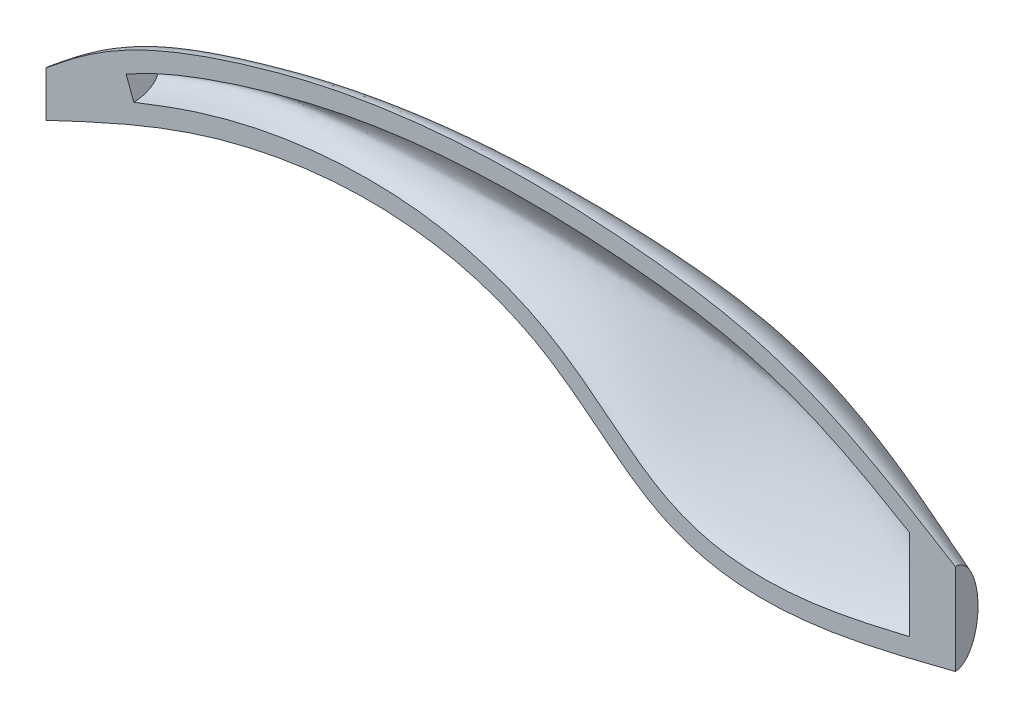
ISO-10303-21;
HEADER;
FILE_DESCRIPTION(('STEP AP214'),'2;1');
FILE_NAME('part.step','',(''),(''),'','','');
FILE_SCHEMA(('AUTOMOTIVE_DESIGN { 1 0 10303 214 1 1 1 1 }'));
ENDSEC;
DATA;
#1=APPLICATION_CONTEXT('core data for automotive mechanical design processes');
#2=APPLICATION_PROTOCOL_DEFINITION('international standard','automotive_design',2000,#1);
#3=PRODUCT_CONTEXT('',#1,'mechanical');
#4=PRODUCT('Part','Part','',(#3));
#5=PRODUCT_RELATED_PRODUCT_CATEGORY('part','',(#4));
#6=PRODUCT_DEFINITION_FORMATION('','',#4);
#7=PRODUCT_DEFINITION_CONTEXT('part definition',#1,'design');
#8=PRODUCT_DEFINITION('design','',#6,#7);
#9=PRODUCT_DEFINITION_SHAPE('','',#8);
#10=(LENGTH_UNIT() NAMED_UNIT(*) SI_UNIT(.MILLI.,.METRE.));
#11=(NAMED_UNIT(*) PLANE_ANGLE_UNIT() SI_UNIT($,.RADIAN.));
#12=(NAMED_UNIT(*) SI_UNIT($,.STERADIAN.) SOLID_ANGLE_UNIT());
#13=UNCERTAINTY_MEASURE_WITH_UNIT(LENGTH_MEASURE(1.E-05),#10,'distance_accuracy_value','');
#14=(GEOMETRIC_REPRESENTATION_CONTEXT(3) GLOBAL_UNCERTAINTY_ASSIGNED_CONTEXT((#13)) GLOBAL_UNIT_ASSIGNED_CONTEXT((#10,
#11,#12)) REPRESENTATION_CONTEXT('',''));
#15=CARTESIAN_POINT('',(0.,0.,0.));
#16=DIRECTION('',(0.,0.,1.));
#17=DIRECTION('',(1.,0.,0.));
#18=AXIS2_PLACEMENT_3D('',#15,#16,#17);
#19=CARTESIAN_POINT('',(100.,0.,-1.66533453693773E-13));
#20=DIRECTION('',(1.,0.,0.));
#21=DIRECTION('',(0.,0.,-1.));
#22=AXIS2_PLACEMENT_3D('',#19,#20,#21);
#23=PLANE('',#22);
#24=CARTESIAN_POINT('',(100.,0.,-1.66533453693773E-13));
#25=DIRECTION('',(1.,0.,0.));
#26=DIRECTION('',(0.,1.,0.));
#27=AXIS2_PLACEMENT_3D('',#24,#25,#26);
#28=ELLIPSE('',#27,5.,2.5);
#29=CARTESIAN_POINT('',(100.,-4.99999999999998,-9.75442643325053E-09));
#30=VERTEX_POINT('',#29);
#31=CARTESIAN_POINT('',(100.,5.,-1.66533453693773E-13));
#32=VERTEX_POINT('',#31);
#33=EDGE_CURVE('E280',#30,#32,#28,.T.);
#34=ORIENTED_EDGE('',*,*,#33,.T.);
#35=DIRECTION('',(0.,-1.,0.));
#36=VECTOR('',#35,1.);
#37=CARTESIAN_POINT('',(100.,0.,-1.66533453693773E-13));
#38=LINE('',#37,#36);
#39=EDGE_CURVE('E228',#32,#30,#38,.T.);
#40=ORIENTED_EDGE('',*,*,#39,.T.);
#41=EDGE_LOOP('',(#34,#40));
#42=FACE_BOUND('',#41,.T.);
#43=ADVANCED_FACE('F162',(#42),#23,.T.);
#44=CARTESIAN_POINT('',(0.,0.,0.));
#45=DIRECTION('',(1.,0.,0.));
#46=DIRECTION('',(0.,0.,-1.));
#47=AXIS2_PLACEMENT_3D('',#44,#45,#46);
#48=PLANE('',#47);
#49=DIRECTION('',(0.,-1.,0.));
#50=VECTOR('',#49,1.);
#51=CARTESIAN_POINT('',(0.,0.,0.));
#52=LINE('',#51,#50);
#53=CARTESIAN_POINT('',(0.,2.5,0.));
#54=VERTEX_POINT('',#53);
#55=CARTESIAN_POINT('',(0.,-2.5,0.));
#56=VERTEX_POINT('',#55);
#57=EDGE_CURVE('E189',#54,#56,#52,.T.);
#58=ORIENTED_EDGE('',*,*,#57,.F.);
#59=CARTESIAN_POINT('',(0.,0.,0.));
#60=DIRECTION('',(1.,0.,0.));
#61=DIRECTION('',(0.,0.,-1.));
#62=AXIS2_PLACEMENT_3D('',#59,#60,#61);
#63=CIRCLE('',#62,2.5);
#64=EDGE_CURVE('E316',#56,#54,#63,.T.);
#65=ORIENTED_EDGE('',*,*,#64,.F.);
#66=EDGE_LOOP('',(#58,#65));
#67=FACE_BOUND('',#66,.T.);
#68=ADVANCED_FACE('F263',(#67),#48,.F.);
#69=CARTESIAN_POINT('',(0.,0.,2.5));
#70=CARTESIAN_POINT('',(3.84489070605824,1.82013799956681,3.74978215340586));
#71=CARTESIAN_POINT('',(9.67722522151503,4.58408071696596,4.83507673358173));
#72=CARTESIAN_POINT('',(17.8094061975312,7.74794715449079,4.84543905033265));
#73=CARTESIAN_POINT('',(24.1454404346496,9.69713337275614,4.39354035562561));
#74=CARTESIAN_POINT('',(31.0768456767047,11.1941310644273,3.87629492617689));
#75=CARTESIAN_POINT('',(35.9469812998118,11.7348801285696,3.81187212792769));
#76=CARTESIAN_POINT('',(42.5323384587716,12.0055178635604,3.91449403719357));
#77=CARTESIAN_POINT('',(47.9547882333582,11.705977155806,4.22134233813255));
#78=CARTESIAN_POINT('',(53.7185352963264,10.373478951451,4.87735172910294));
#79=CARTESIAN_POINT('',(59.8694988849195,8.44802745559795,5.72368883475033));
#80=CARTESIAN_POINT('',(64.3626768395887,6.14668240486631,6.70088066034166));
#81=CARTESIAN_POINT('',(70.382773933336,3.74543981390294,7.63659148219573));
#82=CARTESIAN_POINT('',(74.4765659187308,2.3889801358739,8.16155382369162));
#83=CARTESIAN_POINT('',(81.0307596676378,1.12159315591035,7.81292230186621));
#84=CARTESIAN_POINT('',(89.5531685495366,0.240144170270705,6.04000311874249));
#85=CARTESIAN_POINT('',(95.8183021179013,0.0987510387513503,3.87377335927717));
#86=CARTESIAN_POINT('',(100.,5.32093618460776E-07,2.49999999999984));
#87=CARTESIAN_POINT('',(0.,-0.163624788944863,2.5));
#88=CARTESIAN_POINT('',(3.91735330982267,1.67661401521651,3.74978227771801));
#89=CARTESIAN_POINT('',(9.85838173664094,4.47070794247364,4.83507696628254));
#90=CARTESIAN_POINT('',(18.1176772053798,7.65051201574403,4.84543928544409));
#91=CARTESIAN_POINT('',(24.5357666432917,9.59344074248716,4.39354054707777));
#92=CARTESIAN_POINT('',(31.5263304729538,11.0590966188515,3.8762950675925));
#93=CARTESIAN_POINT('',(36.4022655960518,11.5552723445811,3.81187226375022));
#94=CARTESIAN_POINT('',(42.9582093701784,11.7460337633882,3.91449418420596));
#95=CARTESIAN_POINT('',(48.3482658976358,11.3742377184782,4.22134251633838));
#96=CARTESIAN_POINT('',(54.0530661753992,9.9372941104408,4.87735197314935));
#97=CARTESIAN_POINT('',(60.1281969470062,7.88585699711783,5.72368916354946));
#98=CARTESIAN_POINT('',(64.5473020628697,5.47735687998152,6.70088108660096));
#99=CARTESIAN_POINT('',(70.4911126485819,3.0098063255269,7.63659200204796));
#100=CARTESIAN_POINT('',(74.5404863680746,1.63302839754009,8.16155439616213));
#101=CARTESIAN_POINT('',(81.0486490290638,0.404055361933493,7.81292284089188));
#102=CARTESIAN_POINT('',(89.5425552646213,-0.329504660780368,6.04000348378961));
#103=CARTESIAN_POINT('',(95.8140568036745,-0.280490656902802,3.87377351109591));
#104=CARTESIAN_POINT('',(100.,-0.252303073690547,2.49999999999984));
#105=CARTESIAN_POINT('',(0.,-0.490856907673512,2.46748222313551));
#106=CARTESIAN_POINT('',(4.02761544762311,1.38155715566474,3.69829879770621));
#107=CARTESIAN_POINT('',(10.132005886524,4.22285973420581,4.76747884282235));
#108=CARTESIAN_POINT('',(18.5871657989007,7.42210125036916,4.77880312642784));
#109=CARTESIAN_POINT('',(25.1368177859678,9.34796661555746,4.33480813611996));
#110=CARTESIAN_POINT('',(32.2299241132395,10.7538516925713,3.82655745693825));
#111=CARTESIAN_POINT('',(37.1222223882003,11.1678488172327,3.76377320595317));
#112=CARTESIAN_POINT('',(43.6371979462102,11.2128594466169,3.86563458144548));
#113=CARTESIAN_POINT('',(48.9736983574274,10.7056286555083,4.168371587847));
#114=CARTESIAN_POINT('',(54.5770822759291,9.06923142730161,4.81490389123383));
#115=CARTESIAN_POINT('',(60.5180163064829,6.77607756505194,5.64886010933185));
#116=CARTESIAN_POINT('',(64.8044865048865,4.16639749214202,6.61143526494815));
#117=CARTESIAN_POINT('',(70.6181687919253,1.58696212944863,7.53336875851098));
#118=CARTESIAN_POINT('',(74.5941896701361,0.183162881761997,8.05069063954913));
#119=CARTESIAN_POINT('',(81.0253024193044,-0.960482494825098,7.7083492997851));
#120=CARTESIAN_POINT('',(89.4875564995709,-1.41402899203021,5.96425538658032));
#121=CARTESIAN_POINT('',(95.7921499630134,-1.01713436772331,3.83271530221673));
#122=CARTESIAN_POINT('',(100.,-0.756886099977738,2.48096867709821));
#123=CARTESIAN_POINT('',(0.,-0.962993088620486,2.32480566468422));
#124=CARTESIAN_POINT('',(4.10822337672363,0.936794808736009,3.47739345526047));
#125=CARTESIAN_POINT('',(10.3259087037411,3.81520473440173,4.48010812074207));
#126=CARTESIAN_POINT('',(18.9316280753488,7.0122325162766,4.49541129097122));
#127=CARTESIAN_POINT('',(25.5976985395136,8.90143765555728,4.08402758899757));
#128=CARTESIAN_POINT('',(32.8035794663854,10.2256229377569,3.61288949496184));
#129=CARTESIAN_POINT('',(37.7305981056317,10.5351459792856,3.55687037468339));
#130=CARTESIAN_POINT('',(44.2270605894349,10.3991050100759,3.65560254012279));
#131=CARTESIAN_POINT('',(49.5115320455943,9.71476769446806,3.94138672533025));
#132=CARTESIAN_POINT('',(55.0053914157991,7.80891529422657,4.54883284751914));
#133=CARTESIAN_POINT('',(60.7914446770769,5.18665209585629,5.33172520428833));
#134=CARTESIAN_POINT('',(64.9208060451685,2.31369447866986,6.23401193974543));
#135=CARTESIAN_POINT('',(70.5969483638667,-0.382124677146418,7.0991211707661));
#136=CARTESIAN_POINT('',(74.5019424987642,-1.79486222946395,7.58493105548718));
#137=CARTESIAN_POINT('',(80.8555733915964,-2.79641092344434,7.26854512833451));
#138=CARTESIAN_POINT('',(89.3300659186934,-2.88116227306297,5.64336788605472));
#139=CARTESIAN_POINT('',(95.7295012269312,-2.05581609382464,3.65493281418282));
#140=CARTESIAN_POINT('',(99.9999999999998,-1.50940744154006,2.39405329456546));
#141=CARTESIAN_POINT('',(0.,-1.39775765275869,2.09188265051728));
#142=CARTESIAN_POINT('',(4.12324995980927,0.511755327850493,3.12345558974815));
#143=CARTESIAN_POINT('',(10.3528113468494,3.3992181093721,4.02327743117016));
#144=CARTESIAN_POINT('',(18.9977093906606,6.56870646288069,4.04449856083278));
#145=CARTESIAN_POINT('',(25.7159911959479,8.41284160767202,3.68334077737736));
#146=CARTESIAN_POINT('',(32.9998924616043,9.66258314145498,3.26937075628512));
#147=CARTESIAN_POINT('',(37.9676902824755,9.88437208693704,3.22367682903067));
#148=CARTESIAN_POINT('',(44.47794253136,9.60049862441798,3.31739950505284));
#149=CARTESIAN_POINT('',(49.733304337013,8.76397934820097,3.57684327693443));
#150=CARTESIAN_POINT('',(55.1534075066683,6.61987992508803,4.12372435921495));
#151=CARTESIAN_POINT('',(60.8250020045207,3.70475097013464,4.82752627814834));
#152=CARTESIAN_POINT('',(64.8344093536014,0.606168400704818,5.63650575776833));
#153=CARTESIAN_POINT('',(70.4209825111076,-2.16526560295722,6.41362209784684));
#154=CARTESIAN_POINT('',(74.2865038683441,-3.56454934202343,6.85061592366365));
#155=CARTESIAN_POINT('',(80.5938021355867,-4.42121481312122,6.57416954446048));
#156=CARTESIAN_POINT('',(89.1239070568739,-4.19222747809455,5.13254167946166));
#157=CARTESIAN_POINT('',(95.6475241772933,-3.02629208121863,3.36509583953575));
#158=CARTESIAN_POINT('',(100.,-2.25208753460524,2.24453194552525));
#159=CARTESIAN_POINT('',(0.,-1.77932828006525,1.77932828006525));
#160=CARTESIAN_POINT('',(4.09189912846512,0.125702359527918,2.65364665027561));
#161=CARTESIAN_POINT('',(10.2622470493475,3.00011617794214,3.41934247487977));
#162=CARTESIAN_POINT('',(18.8667993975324,6.12318565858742,3.44692814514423));
#163=CARTESIAN_POINT('',(25.589803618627,7.91679798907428,3.14979815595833));
#164=CARTESIAN_POINT('',(32.9232558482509,9.09897804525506,2.8087592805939));
#165=CARTESIAN_POINT('',(37.933774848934,9.24794512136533,2.77569975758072));
#166=CARTESIAN_POINT('',(44.4794832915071,8.84540432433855,2.86196905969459));
#167=CARTESIAN_POINT('',(49.7232688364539,7.88075099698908,3.08653867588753));
#168=CARTESIAN_POINT('',(55.0985525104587,5.5313720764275,3.55415153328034));
#169=CARTESIAN_POINT('',(60.6901179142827,2.3627002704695,4.15463054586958));
#170=CARTESIAN_POINT('',(64.6120373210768,-0.924461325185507,4.84210902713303));
#171=CARTESIAN_POINT('',(70.1473304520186,-3.74111417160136,5.50438163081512));
#172=CARTESIAN_POINT('',(73.9974844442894,-5.11355251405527,5.87755468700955));
#173=CARTESIAN_POINT('',(80.2826555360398,-5.83356534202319,5.65182431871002));
#174=CARTESIAN_POINT('',(88.8954040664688,-5.3493250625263,4.44643711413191));
#175=CARTESIAN_POINT('',(95.5566789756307,-3.92485421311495,2.9640070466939));
#176=CARTESIAN_POINT('',(99.9999999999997,-2.97745108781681,2.02438122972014));
#177=CARTESIAN_POINT('',(0.,-2.09188265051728,1.39775765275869));
#178=CARTESIAN_POINT('',(4.03337481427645,-0.201849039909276,2.08488438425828));
#179=CARTESIAN_POINT('',(10.1037490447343,2.64374378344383,2.69004969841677));
#180=CARTESIAN_POINT('',(18.6202877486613,5.70846401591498,2.72246659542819));
#181=CARTESIAN_POINT('',(25.3172436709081,7.44943477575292,2.49898796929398));
#182=CARTESIAN_POINT('',(32.6780623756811,8.57097029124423,2.24195497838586));
#183=CARTESIAN_POINT('',(37.7291277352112,8.66048270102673,2.22231415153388));
#184=CARTESIAN_POINT('',(44.3213223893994,8.16476289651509,2.29775703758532));
#185=CARTESIAN_POINT('',(49.5656791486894,7.09545240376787,2.47947634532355));
#186=CARTESIAN_POINT('',(54.9182483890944,4.57586667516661,2.85155828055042));
#187=CARTESIAN_POINT('',(60.458222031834,1.19643136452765,3.32791047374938));
#188=CARTESIAN_POINT('',(64.3204308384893,-2.24257843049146,3.87023667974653));
#189=CARTESIAN_POINT('',(69.8330514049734,-5.0840499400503,4.39476693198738));
#190=CARTESIAN_POINT('',(73.6844948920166,-6.4250004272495,4.69117015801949));
#191=CARTESIAN_POINT('',(79.9648004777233,-7.02723119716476,4.52335903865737));
#192=CARTESIAN_POINT('',(88.6708810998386,-6.34915017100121,3.59447495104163));
#193=CARTESIAN_POINT('',(95.4674257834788,-4.74201194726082,2.44686396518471));
#194=CARTESIAN_POINT('',(100.,-3.67198897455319,1.7197289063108));
#195=CARTESIAN_POINT('',(0.,-2.28598516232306,1.03545384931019));
#196=CARTESIAN_POINT('',(3.97796325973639,-0.413565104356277,1.54637798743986));
#197=CARTESIAN_POINT('',(9.95633364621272,2.40099508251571,1.99901673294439));
#198=CARTESIAN_POINT('',(18.3863513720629,5.41407771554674,2.0315035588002));
#199=CARTESIAN_POINT('',(25.0498899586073,7.11304665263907,1.87316747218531));
#200=CARTESIAN_POINT('',(32.4202643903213,8.19076234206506,1.69062600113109));
#201=CARTESIAN_POINT('',(37.4998753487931,8.24122083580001,1.68097194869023));
#202=CARTESIAN_POINT('',(44.1311365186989,7.68688150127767,1.74303634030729));
#203=CARTESIAN_POINT('',(49.3816039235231,6.55013655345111,1.88223981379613));
#204=CARTESIAN_POINT('',(54.7279723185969,3.92047586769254,2.1624868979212));
#205=CARTESIAN_POINT('',(60.2436569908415,0.404787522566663,2.52014929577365));
#206=CARTESIAN_POINT('',(64.0753474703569,-3.12975619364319,2.92499491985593));
#207=CARTESIAN_POINT('',(69.5848457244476,-5.9823862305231,3.31817991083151));
#208=CARTESIAN_POINT('',(73.4450373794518,-7.29995012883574,3.54101622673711));
#209=CARTESIAN_POINT('',(79.7298866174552,-7.82776794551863,3.42372484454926));
#210=CARTESIAN_POINT('',(88.5090321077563,-7.04063064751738,2.74742629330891));
#211=CARTESIAN_POINT('',(95.4030915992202,-5.33848487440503,1.90770995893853));
#212=CARTESIAN_POINT('',(99.9999999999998,-4.20450988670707,1.37587208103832));
#213=CARTESIAN_POINT('',(0.,-2.39614394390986,0.726924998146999));
#214=CARTESIAN_POINT('',(3.93925120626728,-0.537930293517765,1.08729909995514));
#215=CARTESIAN_POINT('',(9.85396770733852,2.25242111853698,1.40815993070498));
#216=CARTESIAN_POINT('',(18.2227910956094,5.22807563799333,1.4361119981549));
#217=CARTESIAN_POINT('',(24.8609286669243,6.89789136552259,1.32914030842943));
#218=CARTESIAN_POINT('',(32.2341403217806,7.94639845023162,1.20554308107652));
#219=CARTESIAN_POINT('',(37.3313835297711,7.97238198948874,1.20170870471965));
#220=CARTESIAN_POINT('',(43.9887765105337,7.38238792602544,1.24907150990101));
#221=CARTESIAN_POINT('',(49.2448202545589,6.2046243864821,1.34971089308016));
#222=CARTESIAN_POINT('',(54.5904488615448,3.50853824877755,1.54953101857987));
#223=CARTESIAN_POINT('',(60.0949286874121,-0.0891328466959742,1.80388506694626));
#224=CARTESIAN_POINT('',(63.9114044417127,-3.68037289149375,2.09039369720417));
#225=CARTESIAN_POINT('',(69.423026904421,-6.53955192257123,2.36962228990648));
#226=CARTESIAN_POINT('',(73.2910969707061,-7.84338540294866,2.52826412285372));
#227=CARTESIAN_POINT('',(79.5812681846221,-8.32957459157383,2.45003381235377));
#228=CARTESIAN_POINT('',(88.4078670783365,-7.48592674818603,1.98166194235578));
#229=CARTESIAN_POINT('',(95.362880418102,-5.73734972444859,1.39755664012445));
#230=CARTESIAN_POINT('',(100.,-4.57203486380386,1.02774100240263));
#231=CARTESIAN_POINT('',(0.,-2.45574473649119,0.488517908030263));
#232=CARTESIAN_POINT('',(3.91542625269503,-0.607071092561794,0.731777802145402));
#233=CARTESIAN_POINT('',(9.79116809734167,2.16729011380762,0.949237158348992));
#234=CARTESIAN_POINT('',(18.1220890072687,5.11910514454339,0.970854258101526));
#235=CARTESIAN_POINT('',(24.7439320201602,6.77076333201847,0.901215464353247));
#236=CARTESIAN_POINT('',(32.1176535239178,7.80144700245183,0.820598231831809));
#237=CARTESIAN_POINT('',(37.2250042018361,7.81306487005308,0.819633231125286));
#238=CARTESIAN_POINT('',(43.8981057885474,7.2025570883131,0.853561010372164));
#239=CARTESIAN_POINT('',(49.1580024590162,6.00128704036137,0.92283361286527));
#240=CARTESIAN_POINT('',(54.5043327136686,3.2674401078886,1.05889010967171));
#241=CARTESIAN_POINT('',(60.0037730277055,-0.376709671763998,1.23171991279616));
#242=CARTESIAN_POINT('',(63.8128516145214,-3.99982139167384,1.42564057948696));
#243=CARTESIAN_POINT('',(69.327168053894,-6.86290624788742,1.61516251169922));
#244=CARTESIAN_POINT('',(73.200655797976,-8.15931399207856,1.72304943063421));
#245=CARTESIAN_POINT('',(79.4947940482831,-8.62349609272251,1.67269761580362));
#246=CARTESIAN_POINT('',(88.3494409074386,-7.75177640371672,1.36125521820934));
#247=CARTESIAN_POINT('',(95.3396576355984,-5.98132364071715,0.971434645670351));
#248=CARTESIAN_POINT('',(99.9999999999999,-4.80120143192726,0.724698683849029));
#249=CARTESIAN_POINT('',(0.,-2.49187055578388,0.245432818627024));
#250=CARTESIAN_POINT('',(3.89921087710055,-0.650212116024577,0.368134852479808));
#251=CARTESIAN_POINT('',(9.74853498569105,2.11253910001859,0.478183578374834));
#252=CARTESIAN_POINT('',(18.0535287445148,5.04751169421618,0.490224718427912));
#253=CARTESIAN_POINT('',(24.6639231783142,6.68655908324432,0.456161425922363));
#254=CARTESIAN_POINT('',(32.0373220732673,7.70504750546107,0.416661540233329));
#255=CARTESIAN_POINT('',(37.1511489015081,7.70716370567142,0.416846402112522));
#256=CARTESIAN_POINT('',(43.8347392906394,7.08333254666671,0.434769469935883));
#257=CARTESIAN_POINT('',(49.0974863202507,5.86689499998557,0.47026504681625));
#258=CARTESIAN_POINT('',(54.4449207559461,3.10891315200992,0.539378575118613));
#259=CARTESIAN_POINT('',(59.9419366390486,-0.564852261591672,0.627025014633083));
#260=CARTESIAN_POINT('',(63.7470458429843,-4.2081245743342,0.725055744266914));
#261=CARTESIAN_POINT('',(69.2639468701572,-7.07393619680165,0.821080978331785));
#262=CARTESIAN_POINT('',(73.1414300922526,-8.36593551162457,0.87583108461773));
#263=CARTESIAN_POINT('',(79.4386429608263,-8.81723229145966,0.851449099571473));
#264=CARTESIAN_POINT('',(88.3117528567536,-7.93022080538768,0.696307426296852));
#265=CARTESIAN_POINT('',(95.3246779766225,-6.14864417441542,0.501525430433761));
#266=CARTESIAN_POINT('',(100.,-4.96096143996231,0.378268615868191));
#267=CARTESIAN_POINT('',(0.,-2.5,0.0818123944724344));
#268=CARTESIAN_POINT('',(3.89507400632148,-0.660148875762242,0.12271560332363));
#269=CARTESIAN_POINT('',(9.73768501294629,2.09962780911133,0.159402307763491));
#270=CARTESIAN_POINT('',(18.0360322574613,5.03037301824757,0.163421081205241));
#271=CARTESIAN_POINT('',(24.6434181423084,6.66630671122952,0.152070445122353));
#272=CARTESIAN_POINT('',(32.0165707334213,7.68184727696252,0.138907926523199));
#273=CARTESIAN_POINT('',(37.1319510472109,7.68173098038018,0.138972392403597));
#274=CARTESIAN_POINT('',(43.8181677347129,7.0548225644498,0.144950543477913));
#275=CARTESIAN_POINT('',(49.0816977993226,5.83485314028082,0.156785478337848));
#276=CARTESIAN_POINT('',(54.429567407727,3.07124906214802,0.179826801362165));
#277=CARTESIAN_POINT('',(59.9262110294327,-0.609412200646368,0.209046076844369));
#278=CARTESIAN_POINT('',(63.7305684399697,-4.25732489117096,0.241725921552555));
#279=CARTESIAN_POINT('',(69.2483127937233,-7.12368346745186,0.273738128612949));
#280=CARTESIAN_POINT('',(73.1268908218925,-8.41460590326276,0.291990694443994));
#281=CARTESIAN_POINT('',(79.4249798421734,-8.86296247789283,0.283867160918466));
#282=CARTESIAN_POINT('',(88.302646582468,-7.97276324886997,0.232158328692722));
#283=CARTESIAN_POINT('',(95.3210586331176,-6.18910530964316,0.167234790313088));
#284=CARTESIAN_POINT('',(100.,-5.,0.126151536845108));
#285=CARTESIAN_POINT('',(0.,-2.5,-0.0818122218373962));
#286=CARTESIAN_POINT('',(3.89507398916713,-0.660148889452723,-0.12271534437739));
#287=CARTESIAN_POINT('',(9.73768497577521,2.09962777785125,-0.159401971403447));
#288=CARTESIAN_POINT('',(18.0360321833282,5.0303729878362,-0.163420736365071));
#289=CARTESIAN_POINT('',(24.6434180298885,6.66630669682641,-0.152070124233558));
#290=CARTESIAN_POINT('',(32.0165705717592,7.68184729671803,-0.138907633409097));
#291=CARTESIAN_POINT('',(37.1319508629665,7.68173104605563,-0.138972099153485));
#292=CARTESIAN_POINT('',(43.8181675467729,7.0548227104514,-0.144950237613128));
#293=CARTESIAN_POINT('',(49.0816976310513,5.83485336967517,-0.15678514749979));
#294=CARTESIAN_POINT('',(54.4295672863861,3.07124942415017,-0.179826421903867));
#295=CARTESIAN_POINT('',(59.9262109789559,-0.609411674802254,-0.209045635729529));
#296=CARTESIAN_POINT('',(63.7305684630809,-4.25732423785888,-0.241725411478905));
#297=CARTESIAN_POINT('',(69.248312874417,-7.12368277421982,-0.273737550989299));
#298=CARTESIAN_POINT('',(73.126890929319,-8.41460522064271,-0.291990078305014));
#299=CARTESIAN_POINT('',(79.4249799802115,-8.86296188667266,-0.283866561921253));
#300=CARTESIAN_POINT('',(88.3026466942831,-7.97276285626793,-0.232157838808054));
#301=CARTESIAN_POINT('',(95.3210586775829,-6.18910513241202,-0.167234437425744));
#302=CARTESIAN_POINT('',(100.,-5.,-0.126151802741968));
#303=CARTESIAN_POINT('',(0.,-2.49187058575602,-0.245432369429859));
#304=CARTESIAN_POINT('',(3.89921080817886,-0.650212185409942,-0.368134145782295));
#305=CARTESIAN_POINT('',(9.74853482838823,2.11253897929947,-0.478182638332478));
#306=CARTESIAN_POINT('',(18.0535284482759,5.04751157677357,-0.490223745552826));
#307=CARTESIAN_POINT('',(24.6639227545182,6.68655901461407,-0.456160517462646));
#308=CARTESIAN_POINT('',(32.0373215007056,7.7050475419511,-0.416660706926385));
#309=CARTESIAN_POINT('',(37.1511482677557,7.70716388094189,-0.416845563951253));
#310=CARTESIAN_POINT('',(43.8347386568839,7.08333296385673,-0.43476858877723));
#311=CARTESIAN_POINT('',(49.0974857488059,5.86689566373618,-0.470264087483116));
#312=CARTESIAN_POINT('',(54.4449203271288,3.1089142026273,-0.539377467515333));
#313=CARTESIAN_POINT('',(59.9419364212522,-0.564850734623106,-0.62702371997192));
#314=CARTESIAN_POINT('',(63.7470458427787,-4.20812267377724,-0.725054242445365));
#315=CARTESIAN_POINT('',(69.263947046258,-7.07393416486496,-0.821079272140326));
#316=CARTESIAN_POINT('',(73.1414303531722,-8.36593349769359,-0.875829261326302));
#317=CARTESIAN_POINT('',(79.4386433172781,-8.81723052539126,-0.851447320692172));
#318=CARTESIAN_POINT('',(88.3117531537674,-7.93021960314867,-0.696305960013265));
#319=CARTESIAN_POINT('',(95.3246780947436,-6.14864359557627,-0.50152436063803));
#320=CARTESIAN_POINT('',(100.,-4.96096137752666,-0.378268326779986));
#321=CARTESIAN_POINT('',(0.,-2.45574486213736,-0.488517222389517));
#322=CARTESIAN_POINT('',(3.91542606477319,-0.607071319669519,-0.73177664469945));
#323=CARTESIAN_POINT('',(9.79116765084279,2.16728974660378,-0.949235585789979));
#324=CARTESIAN_POINT('',(18.1220882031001,5.11910472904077,-0.970852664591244));
#325=CARTESIAN_POINT('',(24.743930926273,6.77076297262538,-0.901214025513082));
#326=CARTESIAN_POINT('',(32.1176521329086,7.80144681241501,-0.820596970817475));
#327=CARTESIAN_POINT('',(37.2250027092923,7.81306492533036,-0.819631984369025));
#328=CARTESIAN_POINT('',(43.8981043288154,7.20255758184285,-0.853559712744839));
#329=CARTESIAN_POINT('',(49.1580011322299,6.00128797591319,-0.922832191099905));
#330=CARTESIAN_POINT('',(54.5043316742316,3.26744173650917,-1.05888843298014));
#331=CARTESIAN_POINT('',(60.0037724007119,-0.376707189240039,-1.2317179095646));
#332=CARTESIAN_POINT('',(63.8128514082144,-3.99981822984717,-1.4256382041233));
#333=CARTESIAN_POINT('',(69.3271682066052,-6.86290283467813,-1.6151597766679));
#334=CARTESIAN_POINT('',(73.2006561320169,-8.15931060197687,-1.72304649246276));
#335=CARTESIAN_POINT('',(79.4947945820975,-8.62349315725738,-1.6726947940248));
#336=CARTESIAN_POINT('',(88.3494413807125,-7.75177454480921,-1.36125303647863));
#337=CARTESIAN_POINT('',(95.3396578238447,-5.98132298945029,-0.971433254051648));
#338=CARTESIAN_POINT('',(100.,-4.80120178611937,-0.724698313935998));
#339=CARTESIAN_POINT('',(0.,-2.39614417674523,-0.726924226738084));
#340=CARTESIAN_POINT('',(3.93925086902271,-0.537930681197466,-1.087297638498));
#341=CARTESIAN_POINT('',(9.85396689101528,2.25242051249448,-1.40815785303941));
#342=CARTESIAN_POINT('',(18.222789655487,5.22807494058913,-1.43610986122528));
#343=CARTESIAN_POINT('',(24.8609267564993,6.8978907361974,-1.32913837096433));
#344=CARTESIAN_POINT('',(32.2341379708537,7.94639806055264,-1.20554137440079));
#345=CARTESIAN_POINT('',(37.3313810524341,7.9723819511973,-1.20170700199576));
#346=CARTESIAN_POINT('',(43.988774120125,7.38238851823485,-1.24906971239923));
#347=CARTESIAN_POINT('',(49.2448180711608,6.20462560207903,-1.34970890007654));
#348=CARTESIAN_POINT('',(54.5904471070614,3.50854042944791,-1.54952864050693));
#349=CARTESIAN_POINT('',(60.094927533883,-0.0891294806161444,-1.80388219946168));
#350=CARTESIAN_POINT('',(63.9114038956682,-3.68036857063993,-2.09039028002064));
#351=CARTESIAN_POINT('',(69.4230268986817,-6.53954720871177,-2.36961833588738));
#352=CARTESIAN_POINT('',(73.2910972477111,-7.84338068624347,-2.52825986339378));
#353=CARTESIAN_POINT('',(79.5812687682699,-8.32957046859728,-2.45002969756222));
#354=CARTESIAN_POINT('',(88.4078676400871,-7.48592411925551,-1.98165871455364));
#355=CARTESIAN_POINT('',(95.3628806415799,-5.73734880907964,-1.39755452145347));
#356=CARTESIAN_POINT('',(99.9999999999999,-4.57203538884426,-1.02774009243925));
#357=CARTESIAN_POINT('',(0.,-2.28598550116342,-1.03545312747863));
#358=CARTESIAN_POINT('',(3.977962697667,-0.413565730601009,-1.5463763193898));
#359=CARTESIAN_POINT('',(9.95633226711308,2.40099403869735,-1.9990142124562));
#360=CARTESIAN_POINT('',(18.3863489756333,5.41407638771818,-2.03150093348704));
#361=CARTESIAN_POINT('',(25.0498868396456,7.11304530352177,-1.87316509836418));
#362=CARTESIAN_POINT('',(32.4202606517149,8.19076121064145,-1.6906239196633));
#363=CARTESIAN_POINT('',(37.499871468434,8.24122010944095,-1.68096985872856));
#364=CARTESIAN_POINT('',(44.1311328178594,7.68688153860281,-1.74303410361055));
#365=CARTESIAN_POINT('',(49.3816005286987,6.55013734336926,-1.88223729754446));
#366=CARTESIAN_POINT('',(54.7279695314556,3.92047783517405,-2.16248384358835));
#367=CARTESIAN_POINT('',(60.2436550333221,0.404790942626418,-2.52014556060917));
#368=CARTESIAN_POINT('',(64.0753463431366,-3.12975158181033,-2.92499042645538));
#369=CARTESIAN_POINT('',(69.5848453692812,-5.98238112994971,-3.31817467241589));
#370=CARTESIAN_POINT('',(73.4450374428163,-7.29994503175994,-3.5410105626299));
#371=CARTESIAN_POINT('',(79.7298871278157,-7.82776365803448,-3.42371935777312));
#372=CARTESIAN_POINT('',(88.5090326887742,-7.04062843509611,-2.74742198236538));
#373=CARTESIAN_POINT('',(95.4030918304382,-5.33848505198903,-1.9077071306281));
#374=CARTESIAN_POINT('',(100.,-4.2045120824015,-1.37587067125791));
#375=CARTESIAN_POINT('',(0.,-2.09188295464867,-1.39775723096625));
#376=CARTESIAN_POINT('',(4.03337395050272,-0.20184972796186,-2.08488275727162));
#377=CARTESIAN_POINT('',(10.1037469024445,2.64374252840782,-2.69004697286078));
#378=CARTESIAN_POINT('',(18.6202840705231,5.70846234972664,-2.72246369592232));
#379=CARTESIAN_POINT('',(25.317238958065,7.44943305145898,-2.49898535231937));
#380=CARTESIAN_POINT('',(32.6780568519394,8.57096882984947,-2.24195269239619));
#381=CARTESIAN_POINT('',(37.7291220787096,8.66048174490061,-2.22231183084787));
#382=CARTESIAN_POINT('',(44.3213170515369,8.1647629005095,-2.29775450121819));
#383=CARTESIAN_POINT('',(49.5656742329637,7.09545332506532,-2.4794734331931));
#384=CARTESIAN_POINT('',(54.9182442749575,4.57586900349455,-2.85155466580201));
#385=CARTESIAN_POINT('',(60.4582189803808,1.19643542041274,-3.32790597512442));
#386=CARTESIAN_POINT('',(64.3204288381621,-2.24257292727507,-3.87023120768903));
#387=CARTESIAN_POINT('',(69.8330504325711,-5.08404375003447,-4.39476049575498));
#388=CARTESIAN_POINT('',(73.6844944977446,-6.42499415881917,-4.69116316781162));
#389=CARTESIAN_POINT('',(79.9648006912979,-7.02722580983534,-4.52335223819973));
#390=CARTESIAN_POINT('',(88.6708815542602,-6.3491472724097,-3.59446957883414));
#391=CARTESIAN_POINT('',(95.4674259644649,-4.74201200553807,-2.44686041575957));
#392=CARTESIAN_POINT('',(99.9999999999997,-3.67199157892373,-1.71972694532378));
#393=CARTESIAN_POINT('',(0.,-1.77932831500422,-1.77932831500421));
#394=CARTESIAN_POINT('',(4.09189795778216,0.125701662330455,-2.65364531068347));
#395=CARTESIAN_POINT('',(10.2622441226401,3.00011448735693,-3.41933987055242));
#396=CARTESIAN_POINT('',(18.8667944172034,6.12318303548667,-3.44692530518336));
#397=CARTESIAN_POINT('',(25.5897973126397,7.91679496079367,-3.14979560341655));
#398=CARTESIAN_POINT('',(32.9232485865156,9.09897497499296,-2.80875706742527));
#399=CARTESIAN_POINT('',(37.9337674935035,9.24794239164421,-2.77569748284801));
#400=CARTESIAN_POINT('',(44.4794764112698,8.84540237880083,-2.86196651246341));
#401=CARTESIAN_POINT('',(49.7232624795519,7.88074980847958,-3.08653568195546));
#402=CARTESIAN_POINT('',(55.0985471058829,5.53137211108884,-3.55414772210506));
#403=CARTESIAN_POINT('',(60.6901137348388,2.36270183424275,-4.15462571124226));
#404=CARTESIAN_POINT('',(64.6120343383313,-0.924458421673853,-4.84210307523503));
#405=CARTESIAN_POINT('',(70.1473287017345,-3.74111070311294,-5.50437456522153));
#406=CARTESIAN_POINT('',(73.9974834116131,-5.11354905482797,-5.87754697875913));
#407=CARTESIAN_POINT('',(80.2826552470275,-5.83356300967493,-5.65181679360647));
#408=CARTESIAN_POINT('',(88.8954042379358,-5.34932579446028,-4.44643115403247));
#409=CARTESIAN_POINT('',(95.5566790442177,-3.92485852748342,-2.9640031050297));
#410=CARTESIAN_POINT('',(100.,-2.97745852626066,-2.0243789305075));
#411=CARTESIAN_POINT('',(0.,-1.39775723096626,-2.09188295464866));
#412=CARTESIAN_POINT('',(4.12324862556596,0.511755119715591,-3.12345453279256));
#413=CARTESIAN_POINT('',(10.3528079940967,3.39921694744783,-4.02327511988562));
#414=CARTESIAN_POINT('',(18.9977037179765,6.56870442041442,-4.0444960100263));
#415=CARTESIAN_POINT('',(25.7159840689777,8.41283920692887,-3.68333850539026));
#416=CARTESIAN_POINT('',(32.9998843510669,9.66258077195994,-3.26936881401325));
#417=CARTESIAN_POINT('',(37.9676821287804,9.88437010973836,-3.22367482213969));
#418=CARTESIAN_POINT('',(44.4779349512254,9.60049750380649,-3.31739722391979));
#419=CARTESIAN_POINT('',(49.7332973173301,8.76397901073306,-3.57684055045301));
#420=CARTESIAN_POINT('',(55.1534014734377,6.61988079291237,-4.12372082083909));
#421=CARTESIAN_POINT('',(60.8249972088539,3.70475332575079,-4.82752172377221));
#422=CARTESIAN_POINT('',(64.8344057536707,0.60617209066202,-5.63650009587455));
#423=CARTESIAN_POINT('',(70.4209801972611,-2.16526119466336,-6.41361533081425));
#424=CARTESIAN_POINT('',(74.2865023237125,-3.56454479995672,-6.85060851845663));
#425=CARTESIAN_POINT('',(80.5938013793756,-4.42121116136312,-6.57416231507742));
#426=CARTESIAN_POINT('',(89.123906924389,-4.19222663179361,-5.13253598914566));
#427=CARTESIAN_POINT('',(95.6475241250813,-3.02629465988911,-3.36509213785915));
#428=CARTESIAN_POINT('',(100.,-2.25209326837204,-2.24452978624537));
#429=CARTESIAN_POINT('',(0.,-0.962992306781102,-2.32480601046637));
#430=CARTESIAN_POINT('',(4.10822211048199,0.936794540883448,-3.47739266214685));
#431=CARTESIAN_POINT('',(10.3259055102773,3.81520287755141,-4.48010628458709));
#432=CARTESIAN_POINT('',(18.9316226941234,7.01222887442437,-4.49540927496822));
#433=CARTESIAN_POINT('',(25.5976918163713,8.90143293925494,-4.0840258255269));
#434=CARTESIAN_POINT('',(32.8035718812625,10.2256174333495,-3.61288802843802));
#435=CARTESIAN_POINT('',(37.7305905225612,10.535140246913,-3.55686886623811));
#436=CARTESIAN_POINT('',(44.2270535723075,10.3990992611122,-3.6556008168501));
#437=CARTESIAN_POINT('',(49.5115255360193,9.71476198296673,-3.94138463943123));
#438=CARTESIAN_POINT('',(55.0053857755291,7.80890986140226,-4.5488300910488));
#439=CARTESIAN_POINT('',(60.7914401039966,5.18664709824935,-5.33172160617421));
#440=CARTESIAN_POINT('',(64.9208024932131,2.31368999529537,-6.23400741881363));
#441=CARTESIAN_POINT('',(70.5969459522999,-0.382129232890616,-7.09911573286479));
#442=CARTESIAN_POINT('',(74.5019407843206,-1.79486709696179,-7.58492508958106));
#443=CARTESIAN_POINT('',(80.8555723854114,-2.79641717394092,-7.26853932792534));
#444=CARTESIAN_POINT('',(89.3300655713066,-2.88117179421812,-5.64336340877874));
#445=CARTESIAN_POINT('',(95.7295010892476,-2.05582922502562,-3.65493003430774));
#446=CARTESIAN_POINT('',(99.9999999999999,-1.50942395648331,-2.39405178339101));
#447=CARTESIAN_POINT('',(0.,-0.490856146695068,-2.46748234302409));
#448=CARTESIAN_POINT('',(4.02761456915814,1.38155784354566,-3.69829832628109));
#449=CARTESIAN_POINT('',(10.132003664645,4.22286029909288,-4.76747790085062));
#450=CARTESIAN_POINT('',(18.587162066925,7.4221018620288,-4.778802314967));
#451=CARTESIAN_POINT('',(25.1368131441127,9.3479674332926,-4.33480766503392));
#452=CARTESIAN_POINT('',(32.2299189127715,10.7538529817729,-3.82655736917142));
#453=CARTESIAN_POINT('',(37.1222172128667,11.1678506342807,-3.76377322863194));
#454=CARTESIAN_POINT('',(43.6371931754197,11.2128621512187,-3.86563465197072));
#455=CARTESIAN_POINT('',(48.97369392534,10.7056320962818,-4.16837157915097));
#456=CARTESIAN_POINT('',(54.5770784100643,9.06923582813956,-4.81490362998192));
#457=CARTESIAN_POINT('',(60.5180131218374,6.77608308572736,-5.64885950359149));
#458=CARTESIAN_POINT('',(64.8044839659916,4.16640400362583,-6.61143422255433));
#459=CARTESIAN_POINT('',(70.6181669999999,1.58696953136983,-7.53336732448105));
#460=CARTESIAN_POINT('',(74.5941883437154,0.183170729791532,-8.05068899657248));
#461=CARTESIAN_POINT('',(81.0253015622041,-0.960474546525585,-7.70834794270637));
#462=CARTESIAN_POINT('',(89.4875561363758,-1.41402183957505,-5.96425510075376));
#463=CARTESIAN_POINT('',(95.7921498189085,-1.01712856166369,-3.83271626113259));
#464=CARTESIAN_POINT('',(100.,-0.756882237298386,-2.4809705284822));
#465=CARTESIAN_POINT('',(0.,-0.163624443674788,-2.5));
#466=CARTESIAN_POINT('',(3.91735296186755,1.67661427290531,-3.74978202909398));
#467=CARTESIAN_POINT('',(9.85838085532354,4.47070806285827,-4.83507650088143));
#468=CARTESIAN_POINT('',(18.1176757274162,7.6505120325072,-4.84543881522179));
#469=CARTESIAN_POINT('',(24.5357648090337,9.59344074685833,-4.39354016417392));
#470=CARTESIAN_POINT('',(31.526328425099,11.0590967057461,-3.8762947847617));
#471=CARTESIAN_POINT('',(36.4022635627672,11.5552725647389,-3.81187199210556));
#472=CARTESIAN_POINT('',(42.9582074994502,11.7460342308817,-3.91449389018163));
#473=CARTESIAN_POINT('',(48.3482641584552,11.3742383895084,-4.22134215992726));
#474=CARTESIAN_POINT('',(54.0530646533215,9.93729505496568,-4.87735148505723));
#475=CARTESIAN_POINT('',(60.1281956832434,7.88585826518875,-5.72368850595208));
#476=CARTESIAN_POINT('',(64.5473010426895,5.47735844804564,-6.70088023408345));
#477=CARTESIAN_POINT('',(70.491111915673,3.00980815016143,-7.63659096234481));
#478=CARTESIAN_POINT('',(74.540485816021,1.63303034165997,-8.16155325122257));
#479=CARTESIAN_POINT('',(81.0486486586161,0.404057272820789,-7.81292176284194));
#480=CARTESIAN_POINT('',(89.5425550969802,-0.329503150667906,-6.04000275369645));
#481=CARTESIAN_POINT('',(95.8140567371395,-0.280489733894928,-3.87377320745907));
#482=CARTESIAN_POINT('',(100.,-0.252303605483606,-2.50000000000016));
#483=CARTESIAN_POINT('',(0.,0.163624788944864,-2.5));
#484=CARTESIAN_POINT('',(3.77242829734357,1.96366202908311,-3.74978227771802));
#485=CARTESIAN_POINT('',(9.49606920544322,4.69745361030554,-4.83507696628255));
#486=CARTESIAN_POINT('',(17.501136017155,7.84538248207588,-4.84543928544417));
#487=CARTESIAN_POINT('',(23.7551152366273,9.80082621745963,-4.39354054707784));
#488=CARTESIAN_POINT('',(30.6273619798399,11.3291657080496,-3.8762950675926));
#489=CARTESIAN_POINT('',(35.4916980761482,11.914488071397,-3.81187226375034));
#490=CARTESIAN_POINT('',(42.1064685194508,12.2650020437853,-3.9144941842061));
#491=CARTESIAN_POINT('',(47.5613114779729,12.0377166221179,-4.22134251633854));
#492=CARTESIAN_POINT('',(53.3840052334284,10.8096637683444,-4.87735197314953));
#493=CARTESIAN_POINT('',(59.6108015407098,9.01019783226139,-5.72368916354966));
#494=CARTESIAN_POINT('',(64.1780522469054,6.81600777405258,-6.70088108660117));
#495=CARTESIAN_POINT('',(70.274435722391,4.48107302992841,-7.63659200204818));
#496=CARTESIAN_POINT('',(74.4126458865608,3.14493152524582,-8.16155439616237));
#497=CARTESIAN_POINT('',(81.0128706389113,1.83913055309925,-7.81292284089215));
#498=CARTESIAN_POINT('',(89.5637820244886,0.809792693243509,-6.04000348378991));
#499=CARTESIAN_POINT('',(95.8225475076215,0.477992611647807,-3.87377351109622));
#500=CARTESIAN_POINT('',(100.,0.252303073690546,-2.50000000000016));
#501=CARTESIAN_POINT('',(0.,0.490856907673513,-2.46748222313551));
#502=CARTESIAN_POINT('',(3.59284042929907,2.24266572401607,-3.69829879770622));
#503=CARTESIAN_POINT('',(9.04506834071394,4.9030604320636,-4.76747884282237));
#504=CARTESIAN_POINT('',(16.7375423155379,8.00667522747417,-4.77880312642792));
#505=CARTESIAN_POINT('',(22.7948636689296,9.97008477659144,-4.33480813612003));
#506=CARTESIAN_POINT('',(29.533018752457,11.5640197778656,-3.82655745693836));
#507=CARTESIAN_POINT('',(34.3905199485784,12.2454561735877,-3.76377320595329));
#508=CARTESIAN_POINT('',(41.0819755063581,12.7697236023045,-3.86563458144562));
#509=CARTESIAN_POINT('',(46.612835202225,12.6960239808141,-4.16837158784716));
#510=CARTESIAN_POINT('',(52.5698995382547,11.6862982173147,-4.81490389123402));
#511=CARTESIAN_POINT('',(58.9658301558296,10.1490570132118,-5.64886010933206));
#512=CARTESIAN_POINT('',(63.6967371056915,8.18230643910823,-6.61143526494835));
#513=CARTESIAN_POINT('',(69.9681380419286,6.000717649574,-7.5333687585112));
#514=CARTESIAN_POINT('',(74.2106682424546,4.71882710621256,-8.05069063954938));
#515=CARTESIAN_POINT('',(80.9179672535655,3.34469708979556,-7.70834929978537));
#516=CARTESIAN_POINT('',(89.5512367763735,2.00381599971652,-5.96425538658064));
#517=CARTESIAN_POINT('',(95.8176220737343,1.25826757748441,-3.83271530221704));
#518=CARTESIAN_POINT('',(100.,0.756886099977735,-2.48096867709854));
#519=CARTESIAN_POINT('',(0.,0.962993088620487,-2.32480566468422));
#520=CARTESIAN_POINT('',(3.25226013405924,2.62722850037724,-3.47739345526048));
#521=CARTESIAN_POINT('',(8.18600059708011,5.15230969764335,-4.48010812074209));
#522=CARTESIAN_POINT('',(15.2901821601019,8.16485053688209,-4.49541129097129));
#523=CARTESIAN_POINT('',(20.986976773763,10.1308043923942,-4.08402758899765));
#524=CARTESIAN_POINT('',(27.4940475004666,11.8282819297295,-3.61288949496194));
#525=CARTESIAN_POINT('',(32.3525593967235,12.6664504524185,-3.5568703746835));
#526=CARTESIAN_POINT('',(39.1964668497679,13.4767798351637,-3.65560254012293));
#527=CARTESIAN_POINT('',(44.8635831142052,13.6482534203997,-3.94138672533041));
#528=CARTESIAN_POINT('',(51.053750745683,12.9787585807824,-4.54883284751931));
#529=CARTESIAN_POINT('',(57.7355784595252,11.8475319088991,-5.33172520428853));
#530=CARTESIAN_POINT('',(62.7399246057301,10.2425324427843,-6.23401193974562));
#531=CARTESIAN_POINT('',(69.3172004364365,8.33280727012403,-7.09912117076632));
#532=CARTESIAN_POINT('',(73.7468847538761,7.16196653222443,-7.58493105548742));
#533=CARTESIAN_POINT('',(80.6442573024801,5.70948485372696,-7.26854512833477));
#534=CARTESIAN_POINT('',(89.4554364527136,3.88157182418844,-5.64336788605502));
#535=CARTESIAN_POINT('',(95.7796494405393,2.46056706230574,-3.65493281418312));
#536=CARTESIAN_POINT('',(99.9999999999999,1.50940744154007,-2.39405329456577));
#537=CARTESIAN_POINT('',(0.,1.39775765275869,-2.09188265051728));
#538=CARTESIAN_POINT('',(2.8732720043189,2.96798852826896,-3.12345558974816));
#539=CARTESIAN_POINT('',(7.2278664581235,5.34652815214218,-4.02327743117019));
#540=CARTESIAN_POINT('',(13.6800428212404,8.2560055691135,-4.04449856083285));
#541=CARTESIAN_POINT('',(18.9828743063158,10.2192671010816,-3.68334077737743));
#542=CARTESIAN_POINT('',(25.2462909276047,12.0217682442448,-3.26937075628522));
#543=CARTESIAN_POINT('',(30.1140471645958,13.0208321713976,-3.22367682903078));
#544=CARTESIAN_POINT('',(37.1316793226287,14.1260086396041,-3.31739950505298));
#545=CARTESIAN_POINT('',(42.9458239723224,14.5449576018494,-3.5768432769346));
#546=CARTESIAN_POINT('',(49.3827581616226,14.212795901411,-4.12372435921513));
#547=CARTESIAN_POINT('',(56.3624676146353,13.4821023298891,-4.82752627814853));
#548=CARTESIAN_POINT('',(61.6496303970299,12.2405908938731,-5.63650575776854));
#549=CARTESIAN_POINT('',(68.5521444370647,10.6241524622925,-6.41362209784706));
#550=CARTESIAN_POINT('',(73.183879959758,9.58281410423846,-6.8506159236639));
#551=CARTESIAN_POINT('',(80.2852135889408,8.07469228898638,-6.57416954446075));
#552=CARTESIAN_POINT('',(89.3069878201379,5.76750895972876,-5.13254167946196));
#553=CARTESIAN_POINT('',(95.7207564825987,3.66010805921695,-3.36509583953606));
#554=CARTESIAN_POINT('',(100.,2.25208753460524,-2.24453194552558));
#555=CARTESIAN_POINT('',(0.,1.77932828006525,-1.77932828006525));
#556=CARTESIAN_POINT('',(2.48866669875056,3.25772210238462,-2.65364665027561));
#557=CARTESIAN_POINT('',(6.25416597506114,5.49218069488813,-3.41934247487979));
#558=CARTESIAN_POINT('',(12.0463147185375,8.29881655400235,-3.4469281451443));
#559=CARTESIAN_POINT('',(16.9538502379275,10.2580153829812,-3.14979815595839));
#560=CARTESIAN_POINT('',(22.9784201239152,12.1630264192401,-2.80875928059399));
#561=CARTESIAN_POINT('',(27.8606249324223,13.3185251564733,-2.77569975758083));
#562=CARTESIAN_POINT('',(35.0571031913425,14.710385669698,-2.86196905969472));
#563=CARTESIAN_POINT('',(41.0175883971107,15.3663754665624,-3.08653867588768));
#564=CARTESIAN_POINT('',(47.6970682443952,15.3527345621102,-3.55415153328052));
#565=CARTESIAN_POINT('',(54.9664330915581,14.9986322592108,-4.15463054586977));
#566=CARTESIAN_POINT('',(60.5272125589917,14.1032576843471,-4.84210902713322));
#567=CARTESIAN_POINT('',(67.7503427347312,12.7808060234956,-5.50438163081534));
#568=CARTESIAN_POINT('',(72.5832495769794,11.8760008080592,-5.87755468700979));
#569=CARTESIAN_POINT('',(79.8868572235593,10.3332184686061,-5.65182431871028));
#570=CARTESIAN_POINT('',(89.1302250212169,7.58160316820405,-4.4464371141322));
#571=CARTESIAN_POINT('',(95.65060735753,4.82045882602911,-2.96400704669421));
#572=CARTESIAN_POINT('',(99.9999999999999,2.97745108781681,-2.02438122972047));
#573=CARTESIAN_POINT('',(0.,2.09188265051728,-1.39775765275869));
#574=CARTESIAN_POINT('',(2.1312348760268,3.4889541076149,-2.08488438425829));
#575=CARTESIAN_POINT('',(5.34839919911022,5.59510370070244,-2.69004969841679));
#576=CARTESIAN_POINT('',(10.5281882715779,8.31082837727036,-2.72246659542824));
#577=CARTESIAN_POINT('',(15.0711985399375,10.2680832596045,-2.49898796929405));
#578=CARTESIAN_POINT('',(20.8791061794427,12.2686872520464,-2.24195497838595));
#579=CARTESIAN_POINT('',(25.7779343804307,13.5672535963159,-2.22231415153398));
#580=CARTESIAN_POINT('',(33.1422287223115,15.2203098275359,-2.29775703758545));
#581=CARTESIAN_POINT('',(39.2369070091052,16.0898635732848,-2.4794763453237));
#582=CARTESIAN_POINT('',(46.1368274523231,16.3596707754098,-2.85155828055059));
#583=CARTESIAN_POINT('',(53.6674103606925,16.3393803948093,-3.32791047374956));
#584=CARTESIAN_POINT('',(59.4740291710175,15.7534118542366,-3.87023667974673));
#585=CARTESIAN_POINT('',(66.989168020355,14.7045467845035,-4.39476693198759));
#586=CARTESIAN_POINT('',(72.00658932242,13.9316322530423,-4.69117015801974));
#587=CARTESIAN_POINT('',(79.4952093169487,12.3730599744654,-4.52335903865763));
#588=CARTESIAN_POINT('',(88.9494821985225,9.2384249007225,-3.59447495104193));
#589=CARTESIAN_POINT('',(95.5788662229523,5.89940519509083,-2.44686396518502));
#590=CARTESIAN_POINT('',(100.,3.67198897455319,-1.71972890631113));
#591=CARTESIAN_POINT('',(0.,2.28598516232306,-1.03545384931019));
#592=CARTESIAN_POINT('',(1.88334514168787,3.63043729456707,-1.54637798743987));
#593=CARTESIAN_POINT('',(4.71978835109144,5.6530455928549,-1.99901673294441));
#594=CARTESIAN_POINT('',(9.47540962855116,8.31157216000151,-2.03150355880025));
#595=CARTESIAN_POINT('',(13.7670440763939,10.2710269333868,-1.87316747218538));
#596=CARTESIAN_POINT('',(19.4273678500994,12.3409339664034,-1.69062600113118));
#597=CARTESIAN_POINT('',(24.3393367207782,13.7395219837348,-1.68097194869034));
#598=CARTESIAN_POINT('',(31.8208266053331,15.573709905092,-1.74303634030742));
#599=CARTESIAN_POINT('',(38.007659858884,16.5901092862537,-1.88223981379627));
#600=CARTESIAN_POINT('',(45.0579564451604,17.0525632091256,-2.16248689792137));
#601=CARTESIAN_POINT('',(52.7656808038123,17.2582486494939,-2.52014929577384));
#602=CARTESIAN_POINT('',(58.7385367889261,16.8826999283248,-2.92499491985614));
#603=CARTESIAN_POINT('',(66.4531888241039,16.0263866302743,-3.31817991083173));
#604=CARTESIAN_POINT('',(71.5973439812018,15.3492156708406,-3.54101622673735));
#605=CARTESIAN_POINT('',(79.2127773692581,13.7905996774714,-3.42372484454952));
#606=CARTESIAN_POINT('',(88.815824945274,10.4089653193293,-2.74742629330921));
#607=CARTESIAN_POINT('',(95.5258087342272,6.68676563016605,-1.90770995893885));
#608=CARTESIAN_POINT('',(99.9999999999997,4.20450988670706,-1.37587208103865));
#609=CARTESIAN_POINT('',(0.,2.39614394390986,-0.726924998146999));
#610=CARTESIAN_POINT('',(1.73141075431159,3.71065612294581,-1.08729909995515));
#611=CARTESIAN_POINT('',(4.33436657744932,5.68545532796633,-1.408159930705));
#612=CARTESIAN_POINT('',(8.83017796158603,8.31299902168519,-1.43611199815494));
#613=CARTESIAN_POINT('',(12.9682006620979,10.2765886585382,-1.3291403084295));
#614=CARTESIAN_POINT('',(18.5389267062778,12.3917223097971,-1.2055430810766));
#615=CARTESIAN_POINT('',(23.4594661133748,13.8531078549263,-1.20170870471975));
#616=CARTESIAN_POINT('',(31.0130460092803,15.7999581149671,-1.24907150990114));
#617=CARTESIAN_POINT('',(37.256069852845,16.9072916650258,-1.34971089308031));
#618=CARTESIAN_POINT('',(44.3977306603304,17.4880732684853,-1.54953101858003));
#619=CARTESIAN_POINT('',(52.2127385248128,17.8321386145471,-1.80388506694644));
#620=CARTESIAN_POINT('',(58.2861181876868,17.5855001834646,-2.09039369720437));
#621=CARTESIAN_POINT('',(66.1220916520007,16.8497544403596,-2.3696222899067));
#622=CARTESIAN_POINT('',(71.3435284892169,16.2337348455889,-2.52826412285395));
#623=CARTESIAN_POINT('',(79.0362071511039,14.6802365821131,-2.45003381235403));
#624=CARTESIAN_POINT('',(88.7312432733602,11.1553846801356,-1.98166194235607));
#625=CARTESIAN_POINT('',(95.4922308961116,7.20561686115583,-1.39755664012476));
#626=CARTESIAN_POINT('',(100.,4.57203486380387,-1.02774100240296));
#627=CARTESIAN_POINT('',(0.,2.45574473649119,-0.488517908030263));
#628=CARTESIAN_POINT('',(1.64474749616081,3.75421211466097,-0.731777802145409));
#629=CARTESIAN_POINT('',(4.11447120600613,5.70326392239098,-0.949237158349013));
#630=CARTESIAN_POINT('',(8.46214863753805,8.31499985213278,-0.970854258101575));
#631=CARTESIAN_POINT('',(12.5127199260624,10.2822477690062,-0.90121546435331));
#632=CARTESIAN_POINT('',(18.032654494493,12.4244879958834,-0.820598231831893));
#633=CARTESIAN_POINT('',(22.9582721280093,13.9224488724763,-0.81963323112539));
#634=CARTESIAN_POINT('',(30.5530673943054,15.9344422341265,-0.853561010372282));
#635=CARTESIAN_POINT('',(36.8280350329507,17.0942106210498,-0.922833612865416));
#636=CARTESIAN_POINT('',(44.0215151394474,17.7428327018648,-1.05889010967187));
#637=CARTESIAN_POINT('',(51.8972444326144,18.1660614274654,-1.23171991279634));
#638=CARTESIAN_POINT('',(58.0274616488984,17.9931459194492,-1.42564057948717));
#639=CARTESIAN_POINT('',(65.9322834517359,17.3273849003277,-1.61516251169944));
#640=CARTESIAN_POINT('',(71.1976567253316,16.7473369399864,-1.72304943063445));
#641=CARTESIAN_POINT('',(78.9342197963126,15.1989232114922,-1.67269761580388));
#642=CARTESIAN_POINT('',(88.6820208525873,11.5957488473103,-1.36125521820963));
#643=CARTESIAN_POINT('',(95.4726896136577,7.5191282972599,-0.971434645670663));
#644=CARTESIAN_POINT('',(99.9999999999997,4.80120143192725,-0.724698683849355));
#645=CARTESIAN_POINT('',(0.,2.49187055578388,-0.245432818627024));
#646=CARTESIAN_POINT('',(1.58947060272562,3.78079828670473,-0.368134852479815));
#647=CARTESIAN_POINT('',(3.97418429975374,5.71445343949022,-0.478183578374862));
#648=CARTESIAN_POINT('',(8.22741254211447,8.31737773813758,-0.490224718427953));
#649=CARTESIAN_POINT('',(12.2223027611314,10.2878545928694,-0.456161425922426));
#650=CARTESIAN_POINT('',(17.710024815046,12.4482968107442,-0.416661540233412));
#651=CARTESIAN_POINT('',(22.6389923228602,13.9701302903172,-0.416846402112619));
#652=CARTESIAN_POINT('',(30.2601318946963,16.0243248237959,-0.434769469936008));
#653=CARTESIAN_POINT('',(36.5554117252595,17.2179790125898,-0.470265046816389));
#654=CARTESIAN_POINT('',(43.7817717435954,17.9101993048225,-0.539378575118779));
#655=CARTESIAN_POINT('',(51.6959548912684,18.384192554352,-0.627025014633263));
#656=CARTESIAN_POINT('',(57.8621322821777,18.2585178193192,-0.725055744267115));
#657=CARTESIAN_POINT('',(65.81066151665,17.638240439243,-0.821080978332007));
#658=CARTESIAN_POINT('',(71.1039742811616,17.0818646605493,-0.875831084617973));
#659=CARTESIAN_POINT('',(78.8684253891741,15.5380954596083,-0.851449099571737));
#660=CARTESIAN_POINT('',(88.6500540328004,11.8871142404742,-0.696307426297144));
#661=CARTESIAN_POINT('',(95.4599984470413,7.73144363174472,-0.501525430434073));
#662=CARTESIAN_POINT('',(100.,4.96096143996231,-0.378268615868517));
#663=CARTESIAN_POINT('',(0.,2.5,-0.0818123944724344));
#664=CARTESIAN_POINT('',(1.57627613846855,3.78672177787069,-0.122715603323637));
#665=CARTESIAN_POINT('',(3.94069034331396,5.71680444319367,-0.159402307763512));
#666=CARTESIAN_POINT('',(8.1713831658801,8.31773700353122,-0.163421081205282));
#667=CARTESIAN_POINT('',(12.1530081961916,10.2890531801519,-0.152070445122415));
#668=CARTESIAN_POINT('',(17.6330893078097,12.4538994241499,-0.138907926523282));
#669=CARTESIAN_POINT('',(22.5628853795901,13.9814492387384,-0.138972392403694));
#670=CARTESIAN_POINT('',(30.1903278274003,16.0457216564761,-0.144950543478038));
#671=CARTESIAN_POINT('',(36.4904397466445,17.2474454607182,-0.156785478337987));
#672=CARTESIAN_POINT('',(43.7246031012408,17.9500063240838,-0.179826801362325));
#673=CARTESIAN_POINT('',(51.6478928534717,18.4360223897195,-0.209046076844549));
#674=CARTESIAN_POINT('',(57.8225773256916,18.3215528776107,-0.241725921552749));
#675=CARTESIAN_POINT('',(65.7814854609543,17.7121876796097,-0.273738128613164));
#676=CARTESIAN_POINT('',(71.0814451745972,17.1615423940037,-0.29199069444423));
#677=CARTESIAN_POINT('',(78.8525261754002,15.6190826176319,-0.28386716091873));
#678=CARTESIAN_POINT('',(88.6422743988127,11.9570312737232,-0.232158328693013));
#679=CARTESIAN_POINT('',(95.4569097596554,7.78281251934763,-0.1672347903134));
#680=CARTESIAN_POINT('',(100.,5.,-0.126151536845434));
#681=CARTESIAN_POINT('',(0.,2.5,0.0818122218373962));
#682=CARTESIAN_POINT('',(1.57627635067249,3.78672183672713,0.122715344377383));
#683=CARTESIAN_POINT('',(3.94069087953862,5.71680459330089,0.159401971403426));
#684=CARTESIAN_POINT('',(8.17138406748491,8.31773722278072,0.163420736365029));
#685=CARTESIAN_POINT('',(12.1530093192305,10.2890534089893,0.152070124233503));
#686=CARTESIAN_POINT('',(17.633090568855,12.4538996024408,0.13890763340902));
#687=CARTESIAN_POINT('',(22.5628866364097,13.9814493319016,0.138972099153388));
#688=CARTESIAN_POINT('',(30.1903289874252,16.045721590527,0.144950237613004));
#689=CARTESIAN_POINT('',(36.4904408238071,17.247445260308,0.156785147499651));
#690=CARTESIAN_POINT('',(43.7246040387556,17.9500059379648,0.179826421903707));
#691=CARTESIAN_POINT('',(51.6478936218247,18.4360217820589,0.209045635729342));
#692=CARTESIAN_POINT('',(57.8225779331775,18.3215520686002,0.24172541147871));
#693=CARTESIAN_POINT('',(65.7814858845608,17.7121867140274,0.273737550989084));
#694=CARTESIAN_POINT('',(71.0814454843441,17.1615413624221,0.291990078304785));
#695=CARTESIAN_POINT('',(78.8525263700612,15.6190816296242,0.28386656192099));
#696=CARTESIAN_POINT('',(88.6422744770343,11.9570305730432,0.232157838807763));
#697=CARTESIAN_POINT('',(95.4569097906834,7.78281221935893,0.167234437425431));
#698=CARTESIAN_POINT('',(100.,5.,0.126151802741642));
#699=CARTESIAN_POINT('',(0.,2.49187058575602,0.245432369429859));
#700=CARTESIAN_POINT('',(1.58947118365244,3.78079847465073,0.368134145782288));
#701=CARTESIAN_POINT('',(3.97418576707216,5.71445387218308,0.478182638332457));
#702=CARTESIAN_POINT('',(8.22741501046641,8.31737835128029,0.490223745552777));
#703=CARTESIAN_POINT('',(12.2223058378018,10.2878552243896,0.456160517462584));
#704=CARTESIAN_POINT('',(17.7100282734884,12.4482972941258,0.416660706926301));
#705=CARTESIAN_POINT('',(22.6389957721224,13.9701305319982,0.416845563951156));
#706=CARTESIAN_POINT('',(30.2601350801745,16.0243246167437,0.434768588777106));
#707=CARTESIAN_POINT('',(36.555414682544,17.2179784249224,0.470264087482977));
#708=CARTESIAN_POINT('',(43.7817743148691,17.9101981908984,0.539377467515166));
#709=CARTESIAN_POINT('',(51.6959569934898,18.384190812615,0.627023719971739));
#710=CARTESIAN_POINT('',(57.8621339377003,18.258515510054,0.725054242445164));
#711=CARTESIAN_POINT('',(65.8106626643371,17.6382376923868,0.821079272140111));
#712=CARTESIAN_POINT('',(71.1039751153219,17.0818617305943,0.875829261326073));
#713=CARTESIAN_POINT('',(78.8684259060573,15.5380926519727,0.851447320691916));
#714=CARTESIAN_POINT('',(88.6500542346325,11.8871122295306,0.696305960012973));
#715=CARTESIAN_POINT('',(95.4599985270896,7.73144273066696,0.501524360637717));
#716=CARTESIAN_POINT('',(100.,4.96096137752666,0.37826832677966));
#717=CARTESIAN_POINT('',(0.,2.45574486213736,0.488517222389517));
#718=CARTESIAN_POINT('',(1.64474847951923,3.75421252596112,0.731776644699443));
#719=CARTESIAN_POINT('',(4.11447368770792,5.7032647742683,0.949235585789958));
#720=CARTESIAN_POINT('',(8.46215281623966,8.31500103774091,0.970852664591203));
#721=CARTESIAN_POINT('',(12.5127251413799,10.2822490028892,0.90121402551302));
#722=CARTESIAN_POINT('',(18.0326603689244,12.4244889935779,0.820596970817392));
#723=CARTESIAN_POINT('',(22.9582779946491,13.922449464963,0.819631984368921));
#724=CARTESIAN_POINT('',(30.5530728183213,15.9344420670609,0.853559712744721));
#725=CARTESIAN_POINT('',(36.8280400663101,17.0942098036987,0.922832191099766));
#726=CARTESIAN_POINT('',(44.021519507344,17.7428309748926,1.05888843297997));
#727=CARTESIAN_POINT('',(51.8972479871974,18.1660586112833,1.23171790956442));
#728=CARTESIAN_POINT('',(58.0274644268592,17.9931421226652,1.4256382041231));
#729=CARTESIAN_POINT('',(65.9322853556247,17.32738037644,1.61515977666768));
#730=CARTESIAN_POINT('',(71.1976580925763,16.7473321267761,1.72304649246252));
#731=CARTESIAN_POINT('',(78.9342206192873,15.1989186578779,1.67269479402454));
#732=CARTESIAN_POINT('',(88.6820211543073,11.5957457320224,1.36125303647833));
#733=CARTESIAN_POINT('',(95.4726897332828,7.51912714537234,0.971433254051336));
#734=CARTESIAN_POINT('',(100.,4.80120178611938,0.724698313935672));
#735=CARTESIAN_POINT('',(0.,2.39614417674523,0.726924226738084));
#736=CARTESIAN_POINT('',(1.73141200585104,3.71065672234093,1.08729763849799));
#737=CARTESIAN_POINT('',(4.33436973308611,5.68545649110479,1.40815785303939));
#738=CARTESIAN_POINT('',(8.83018328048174,8.31300060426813,1.43610986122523));
#739=CARTESIAN_POINT('',(12.9682073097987,10.2765902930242,1.32913837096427));
#740=CARTESIAN_POINT('',(18.5389342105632,12.3917236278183,1.20554137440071));
#741=CARTESIAN_POINT('',(23.4594736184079,13.853108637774,1.20170700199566));
#742=CARTESIAN_POINT('',(31.0130529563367,15.7999578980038,1.2490697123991));
#743=CARTESIAN_POINT('',(37.2560762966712,16.9072905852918,1.34970890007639));
#744=CARTESIAN_POINT('',(44.3977362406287,17.4880709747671,1.54952864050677));
#745=CARTESIAN_POINT('',(52.2127430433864,17.8321348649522,1.80388219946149));
#746=CARTESIAN_POINT('',(58.2861216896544,17.5854951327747,2.09039028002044));
#747=CARTESIAN_POINT('',(66.1220940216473,16.8497484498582,2.36961833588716));
#748=CARTESIAN_POINT('',(71.3435301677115,16.2337284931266,2.52825986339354));
#749=CARTESIAN_POINT('',(79.0362081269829,14.6802305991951,2.45002969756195));
#750=CARTESIAN_POINT('',(88.731243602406,11.1553806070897,1.98165871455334));
#751=CARTESIAN_POINT('',(95.4922310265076,7.20561537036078,1.39755452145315));
#752=CARTESIAN_POINT('',(100.,4.57203538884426,1.02774009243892));
#753=CARTESIAN_POINT('',(0.,2.28598550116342,1.03545312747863));
#754=CARTESIAN_POINT('',(1.883346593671,3.63043812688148,1.54637631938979));
#755=CARTESIAN_POINT('',(4.71979200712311,5.65304717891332,1.99901421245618));
#756=CARTESIAN_POINT('',(9.47541580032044,8.31157434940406,2.03150093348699));
#757=CARTESIAN_POINT('',(13.7670518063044,10.2710292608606,1.87316509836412));
#758=CARTESIAN_POINT('',(19.4273766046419,12.3409360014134,1.69062391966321));
#759=CARTESIAN_POINT('',(24.3393454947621,13.7395234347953,1.68096985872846));
#760=CARTESIAN_POINT('',(31.8208347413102,15.5737102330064,1.74303410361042));
#761=CARTESIAN_POINT('',(38.0076674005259,16.5901086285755,1.88223729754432));
#762=CARTESIAN_POINT('',(45.0579629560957,17.0525611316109,2.16248384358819));
#763=CARTESIAN_POINT('',(52.7656860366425,17.2582448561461,2.52014556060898));
#764=CARTESIAN_POINT('',(58.7385407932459,16.8826946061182,2.92499042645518));
#765=CARTESIAN_POINT('',(66.453191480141,16.0263802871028,3.31817467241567));
#766=CARTESIAN_POINT('',(71.5973458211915,15.3492089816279,3.54101056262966));
#767=CARTESIAN_POINT('',(79.2127783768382,13.7905935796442,3.42371935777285));
#768=CARTESIAN_POINT('',(88.8158252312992,10.4089617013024,2.74742198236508));
#769=CARTESIAN_POINT('',(95.525808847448,6.68676524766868,1.90770713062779));
#770=CARTESIAN_POINT('',(100.,4.2045120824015,1.37587067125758));
#771=CARTESIAN_POINT('',(0.,2.09188295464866,1.39775723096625));
#772=CARTESIAN_POINT('',(2.13123632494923,3.48895493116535,2.08488275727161));
#773=CARTESIAN_POINT('',(5.34840283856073,5.59510531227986,2.69004697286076));
#774=CARTESIAN_POINT('',(10.5281944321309,8.3108306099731,2.72246369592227));
#775=CARTESIAN_POINT('',(15.071206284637,10.2680856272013,2.49898535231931));
#776=CARTESIAN_POINT('',(20.8791150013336,12.2686893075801,2.2419526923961));
#777=CARTESIAN_POINT('',(25.7779432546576,13.567255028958,2.22231183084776));
#778=CARTESIAN_POINT('',(33.1422369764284,15.220310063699,2.29775450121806));
#779=CARTESIAN_POINT('',(39.2369146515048,16.0898627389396,2.47947343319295));
#780=CARTESIAN_POINT('',(46.1368340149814,16.3596683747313,2.85155466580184));
#781=CARTESIAN_POINT('',(53.667415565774,16.3393760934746,3.32790597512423));
#782=CARTESIAN_POINT('',(59.4740330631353,15.7534058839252,3.87023120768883));
#783=CARTESIAN_POINT('',(66.9891705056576,14.7045397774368,4.39476049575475));
#784=CARTESIAN_POINT('',(72.0065909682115,13.9316249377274,4.69116316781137));
#785=CARTESIAN_POINT('',(79.4952101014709,12.3730533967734,4.52335223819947));
#786=CARTESIAN_POINT('',(88.9494823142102,9.23842107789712,3.59446957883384));
#787=CARTESIAN_POINT('',(95.5788662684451,5.89940488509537,2.44686041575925));
#788=CARTESIAN_POINT('',(100.,3.67199157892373,1.71972694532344));
#789=CARTESIAN_POINT('',(0.,1.77932831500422,1.77932831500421));
#790=CARTESIAN_POINT('',(2.48866786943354,3.25772279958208,2.65364531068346));
#791=CARTESIAN_POINT('',(6.25416890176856,5.49218238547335,3.41933987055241));
#792=CARTESIAN_POINT('',(12.0463196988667,8.29881917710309,3.4469253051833));
#793=CARTESIAN_POINT('',(16.9538565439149,10.2580184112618,3.14979560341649));
#794=CARTESIAN_POINT('',(22.9784273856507,12.1630294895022,2.80875706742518));
#795=CARTESIAN_POINT('',(27.860632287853,13.3185278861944,2.77569748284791));
#796=CARTESIAN_POINT('',(35.05711007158,14.7103876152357,2.86196651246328));
#797=CARTESIAN_POINT('',(41.017594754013,15.366376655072,3.08653568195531));
#798=CARTESIAN_POINT('',(47.6970736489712,15.3527345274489,3.55414772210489));
#799=CARTESIAN_POINT('',(54.9664372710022,14.9986306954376,4.15462571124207));
#800=CARTESIAN_POINT('',(60.5272155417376,14.1032547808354,4.84210307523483));
#801=CARTESIAN_POINT('',(67.7503444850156,12.7808025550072,5.50437456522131));
#802=CARTESIAN_POINT('',(72.5832506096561,11.8759973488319,5.87754697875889));
#803=CARTESIAN_POINT('',(79.886857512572,10.3332161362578,5.65181679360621));
#804=CARTESIAN_POINT('',(89.1302248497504,7.58160390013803,4.44643115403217));
#805=CARTESIAN_POINT('',(95.6506072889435,4.8204631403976,2.96400310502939));
#806=CARTESIAN_POINT('',(100.,2.97745852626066,2.02437893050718));
#807=CARTESIAN_POINT('',(0.,1.39775723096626,2.09188295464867));
#808=CARTESIAN_POINT('',(2.87327275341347,2.96798860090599,3.12345453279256));
#809=CARTESIAN_POINT('',(7.22786831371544,5.34652895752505,4.0232751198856));
#810=CARTESIAN_POINT('',(13.6800460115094,8.25600704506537,4.04449601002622));
#811=CARTESIAN_POINT('',(18.9828784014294,10.2192688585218,3.68333850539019));
#812=CARTESIAN_POINT('',(25.2462957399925,12.0217700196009,3.26936881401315));
#813=CARTESIAN_POINT('',(30.1140521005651,13.0208336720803,3.22367482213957));
#814=CARTESIAN_POINT('',(37.1316839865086,14.126009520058,3.31739722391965));
#815=CARTESIAN_POINT('',(42.9458282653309,14.544957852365,3.57684055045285));
#816=CARTESIAN_POINT('',(49.3827617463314,14.2127951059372,4.12372082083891));
#817=CARTESIAN_POINT('',(56.3624702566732,13.4821002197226,4.82752172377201));
#818=CARTESIAN_POINT('',(61.6496321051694,12.240587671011,5.63650009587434));
#819=CARTESIAN_POINT('',(68.5521452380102,10.6241488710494,6.41361533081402));
#820=CARTESIAN_POINT('',(73.1838802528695,9.5828106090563,6.85060851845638));
#821=CARTESIAN_POINT('',(80.2852133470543,8.07468982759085,6.57416231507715));
#822=CARTESIAN_POINT('',(89.3069873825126,5.76750903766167,5.13253598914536));
#823=CARTESIAN_POINT('',(95.7207563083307,3.66011100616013,3.36509213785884));
#824=CARTESIAN_POINT('',(100.,2.25209326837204,2.24452978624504));
#825=CARTESIAN_POINT('',(0.,0.962992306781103,2.32480601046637));
#826=CARTESIAN_POINT('',(3.2522604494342,2.62722854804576,3.47739266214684));
#827=CARTESIAN_POINT('',(8.18600135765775,5.15231097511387,4.48010628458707));
#828=CARTESIAN_POINT('',(15.290183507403,8.16485325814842,4.49540927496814));
#829=CARTESIAN_POINT('',(20.9869785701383,10.1308080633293,4.08402582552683));
#830=CARTESIAN_POINT('',(27.4940497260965,11.8282864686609,3.61288802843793));
#831=CARTESIAN_POINT('',(32.3525617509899,12.6664554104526,3.556868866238));
#832=CARTESIAN_POINT('',(39.1964691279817,13.4767851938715,3.65560081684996));
#833=CARTESIAN_POINT('',(44.8635851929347,13.6482589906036,3.94138463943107));
#834=CARTESIAN_POINT('',(51.0537524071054,12.9787641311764,4.54883009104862));
#835=CARTESIAN_POINT('',(57.7355795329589,11.8475373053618,5.33172160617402));
#836=CARTESIAN_POINT('',(62.7399250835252,10.2425376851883,6.23400741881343));
#837=CARTESIAN_POINT('',(69.3172003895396,8.33281315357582,7.09911573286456));
#838=CARTESIAN_POINT('',(73.7468844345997,7.16197310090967,7.58492508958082));
#839=CARTESIAN_POINT('',(80.6442566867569,5.7094930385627,7.26853932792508));
#840=CARTESIAN_POINT('',(89.4554358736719,3.8815828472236,5.64336340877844));
#841=CARTESIAN_POINT('',(95.7796492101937,2.46058079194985,3.65493003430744));
#842=CARTESIAN_POINT('',(100.,1.50942395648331,2.39405178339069));
#843=CARTESIAN_POINT('',(0.,0.490856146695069,2.46748234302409));
#844=CARTESIAN_POINT('',(3.59284043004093,2.24266483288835,3.69829832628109));
#845=CARTESIAN_POINT('',(9.04506831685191,4.9030593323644,4.7674779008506));
#846=CARTESIAN_POINT('',(16.7375423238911,8.00667376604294,4.77880231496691));
#847=CARTESIAN_POINT('',(22.7948637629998,9.97008299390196,4.33480766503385));
#848=CARTESIAN_POINT('',(29.5330190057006,11.5640175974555,3.82655736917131));
#849=CARTESIAN_POINT('',(34.3905202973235,12.2454536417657,3.76377322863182));
#850=CARTESIAN_POINT('',(41.0819759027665,12.7697205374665,3.86563465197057));
#851=CARTESIAN_POINT('',(46.612835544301,12.6960204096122,4.1683715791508));
#852=CARTESIAN_POINT('',(52.5698997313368,11.6862939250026,4.81490362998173));
#853=CARTESIAN_POINT('',(58.965830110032,10.1490518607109,5.64885950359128));
#854=CARTESIAN_POINT('',(63.6967368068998,8.18230062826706,6.61143422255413));
#855=CARTESIAN_POINT('',(69.9681375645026,6.00071147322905,7.53336732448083));
#856=CARTESIAN_POINT('',(74.2106676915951,4.71882082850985,8.05068899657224));
#857=CARTESIAN_POINT('',(80.9179666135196,3.34469092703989,7.7083479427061));
#858=CARTESIAN_POINT('',(89.5512362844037,2.00381023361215,5.96425510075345));
#859=CARTESIAN_POINT('',(95.8176218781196,1.25826232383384,3.83271626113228));
#860=CARTESIAN_POINT('',(100.,0.756882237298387,2.48097052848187));
#861=CARTESIAN_POINT('',(0.,0.163624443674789,2.5));
#862=CARTESIAN_POINT('',(3.77242825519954,1.9636616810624,3.74978202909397));
#863=CARTESIAN_POINT('',(9.49606908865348,4.69745325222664,4.83507650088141));
#864=CARTESIAN_POINT('',(17.5011358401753,7.84538208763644,4.84543881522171));
#865=CARTESIAN_POINT('',(23.7551150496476,9.80082578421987,4.39354016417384));
#866=CARTESIAN_POINT('',(30.6273618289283,11.3291652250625,3.87629478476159));
#867=CARTESIAN_POINT('',(35.4916979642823,11.9144875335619,3.81187199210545));
#868=CARTESIAN_POINT('',(42.1064684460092,12.2650014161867,3.91449389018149));
#869=CARTESIAN_POINT('',(47.5613113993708,12.0377158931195,4.22134215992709));
#870=CARTESIAN_POINT('',(53.3840051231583,10.8096628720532,4.87735148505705));
#871=CARTESIAN_POINT('',(59.6108013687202,9.01019672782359,5.72368850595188));
#872=CARTESIAN_POINT('',(64.1780520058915,6.81600651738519,6.70088023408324));
#873=CARTESIAN_POINT('',(70.2744354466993,4.48107174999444,7.63659096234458));
#874=CARTESIAN_POINT('',(74.4126456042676,3.14493027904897,8.16155325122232));
#875=CARTESIAN_POINT('',(81.0128703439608,1.839129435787,7.81292176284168));
#876=CARTESIAN_POINT('',(89.5637818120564,0.80979179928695,6.04000275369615));
#877=CARTESIAN_POINT('',(95.82254742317,0.477991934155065,3.87377320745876));
#878=CARTESIAN_POINT('',(100.,0.252303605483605,2.49999999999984));
#879=CARTESIAN_POINT('',(0.,0.,2.5));
#880=CARTESIAN_POINT('',(3.84489070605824,1.82013799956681,3.74978215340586));
#881=CARTESIAN_POINT('',(9.67722522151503,4.58408071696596,4.83507673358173));
#882=CARTESIAN_POINT('',(17.8094061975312,7.74794715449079,4.84543905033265));
#883=CARTESIAN_POINT('',(24.1454404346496,9.69713337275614,4.39354035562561));
#884=CARTESIAN_POINT('',(31.0768456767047,11.1941310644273,3.87629492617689));
#885=CARTESIAN_POINT('',(35.9469812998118,11.7348801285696,3.81187212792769));
#886=CARTESIAN_POINT('',(42.5323384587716,12.0055178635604,3.91449403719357));
#887=CARTESIAN_POINT('',(47.9547882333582,11.705977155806,4.22134233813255));
#888=CARTESIAN_POINT('',(53.7185352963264,10.373478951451,4.87735172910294));
#889=CARTESIAN_POINT('',(59.8694988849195,8.44802745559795,5.72368883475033));
#890=CARTESIAN_POINT('',(64.3626768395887,6.14668240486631,6.70088066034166));
#891=CARTESIAN_POINT('',(70.382773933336,3.74543981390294,7.63659148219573));
#892=CARTESIAN_POINT('',(74.4765659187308,2.3889801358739,8.16155382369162));
#893=CARTESIAN_POINT('',(81.0307596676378,1.12159315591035,7.81292230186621));
#894=CARTESIAN_POINT('',(89.5531685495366,0.240144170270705,6.04000311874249));
#895=CARTESIAN_POINT('',(95.8183021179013,0.0987510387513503,3.87377335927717));
#896=CARTESIAN_POINT('',(100.,5.32093618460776E-07,2.49999999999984));
#897=B_SPLINE_SURFACE_WITH_KNOTS('',3,3,((#69,#70,#71,#72,#73,#74,#75,#76,#77,#78,#79,#80,#81,
#82,#83,#84,#85,#86),(#87,#88,#89,#90,#91,#92,#93,#94,#95,#96,#97,#98,#99,#100,#101,#102,#103,
#104),(#105,#106,#107,#108,#109,#110,#111,#112,#113,#114,#115,#116,#117,#118,#119,#120,#121,
#122),(#123,#124,#125,#126,#127,#128,#129,#130,#131,#132,#133,#134,#135,#136,#137,#138,#139,
#140),(#141,#142,#143,#144,#145,#146,#147,#148,#149,#150,#151,#152,#153,#154,#155,#156,#157,
#158),(#159,#160,#161,#162,#163,#164,#165,#166,#167,#168,#169,#170,#171,#172,#173,#174,#175,
#176),(#177,#178,#179,#180,#181,#182,#183,#184,#185,#186,#187,#188,#189,#190,#191,#192,#193,
#194),(#195,#196,#197,#198,#199,#200,#201,#202,#203,#204,#205,#206,#207,#208,#209,#210,#211,
#212),(#213,#214,#215,#216,#217,#218,#219,#220,#221,#222,#223,#224,#225,#226,#227,#228,#229,
#230),(#231,#232,#233,#234,#235,#236,#237,#238,#239,#240,#241,#242,#243,#244,#245,#246,#247,
#248),(#249,#250,#251,#252,#253,#254,#255,#256,#257,#258,#259,#260,#261,#262,#263,#264,#265,
#266),(#267,#268,#269,#270,#271,#272,#273,#274,#275,#276,#277,#278,#279,#280,#281,#282,#283,
#284),(#285,#286,#287,#288,#289,#290,#291,#292,#293,#294,#295,#296,#297,#298,#299,#300,#301,
#302),(#303,#304,#305,#306,#307,#308,#309,#310,#311,#312,#313,#314,#315,#316,#317,#318,#319,
#320),(#321,#322,#323,#324,#325,#326,#327,#328,#329,#330,#331,#332,#333,#334,#335,#336,#337,
#338),(#339,#340,#341,#342,#343,#344,#345,#346,#347,#348,#349,#350,#351,#352,#353,#354,#355,
#356),(#357,#358,#359,#360,#361,#362,#363,#364,#365,#366,#367,#368,#369,#370,#371,#372,#373,
#374),(#375,#376,#377,#378,#379,#380,#381,#382,#383,#384,#385,#386,#387,#388,#389,#390,#391,
#392),(#393,#394,#395,#396,#397,#398,#399,#400,#401,#402,#403,#404,#405,#406,#407,#408,#409,
#410),(#411,#412,#413,#414,#415,#416,#417,#418,#419,#420,#421,#422,#423,#424,#425,#426,#427,
#428),(#429,#430,#431,#432,#433,#434,#435,#436,#437,#438,#439,#440,#441,#442,#443,#444,#445,
#446),(#447,#448,#449,#450,#451,#452,#453,#454,#455,#456,#457,#458,#459,#460,#461,#462,#463,
#464),(#465,#466,#467,#468,#469,#470,#471,#472,#473,#474,#475,#476,#477,#478,#479,#480,#481,
#482),(#483,#484,#485,#486,#487,#488,#489,#490,#491,#492,#493,#494,#495,#496,#497,#498,#499,
#500),(#501,#502,#503,#504,#505,#506,#507,#508,#509,#510,#511,#512,#513,#514,#515,#516,#517,
#518),(#519,#520,#521,#522,#523,#524,#525,#526,#527,#528,#529,#530,#531,#532,#533,#534,#535,
#536),(#537,#538,#539,#540,#541,#542,#543,#544,#545,#546,#547,#548,#549,#550,#551,#552,#553,
#554),(#555,#556,#557,#558,#559,#560,#561,#562,#563,#564,#565,#566,#567,#568,#569,#570,#571,
#572),(#573,#574,#575,#576,#577,#578,#579,#580,#581,#582,#583,#584,#585,#586,#587,#588,#589,
#590),(#591,#592,#593,#594,#595,#596,#597,#598,#599,#600,#601,#602,#603,#604,#605,#606,#607,
#608),(#609,#610,#611,#612,#613,#614,#615,#616,#617,#618,#619,#620,#621,#622,#623,#624,#625,
#626),(#627,#628,#629,#630,#631,#632,#633,#634,#635,#636,#637,#638,#639,#640,#641,#642,#643,
#644),(#645,#646,#647,#648,#649,#650,#651,#652,#653,#654,#655,#656,#657,#658,#659,#660,#661,
#662),(#663,#664,#665,#666,#667,#668,#669,#670,#671,#672,#673,#674,#675,#676,#677,#678,#679,
#680),(#681,#682,#683,#684,#685,#686,#687,#688,#689,#690,#691,#692,#693,#694,#695,#696,#697,
#698),(#699,#700,#701,#702,#703,#704,#705,#706,#707,#708,#709,#710,#711,#712,#713,#714,#715,
#716),(#717,#718,#719,#720,#721,#722,#723,#724,#725,#726,#727,#728,#729,#730,#731,#732,#733,
#734),(#735,#736,#737,#738,#739,#740,#741,#742,#743,#744,#745,#746,#747,#748,#749,#750,#751,
#752),(#753,#754,#755,#756,#757,#758,#759,#760,#761,#762,#763,#764,#765,#766,#767,#768,#769,
#770),(#771,#772,#773,#774,#775,#776,#777,#778,#779,#780,#781,#782,#783,#784,#785,#786,#787,
#788),(#789,#790,#791,#792,#793,#794,#795,#796,#797,#798,#799,#800,#801,#802,#803,#804,#805,
#806),(#807,#808,#809,#810,#811,#812,#813,#814,#815,#816,#817,#818,#819,#820,#821,#822,#823,
#824),(#825,#826,#827,#828,#829,#830,#831,#832,#833,#834,#835,#836,#837,#838,#839,#840,#841,
#842),(#843,#844,#845,#846,#847,#848,#849,#850,#851,#852,#853,#854,#855,#856,#857,#858,#859,
#860),(#861,#862,#863,#864,#865,#866,#867,#868,#869,#870,#871,#872,#873,#874,#875,#876,#877,
#878),(#879,#880,#881,#882,#883,#884,#885,#886,#887,#888,#889,#890,#891,#892,#893,#894,#895,
#896)),.UNSPECIFIED.,.T.,.F.,.F.,(4,1,1,1,1,1,1,1,1,1,2,1,1,1,1,1,1,1,1,1,2,1,1,1,1,1,1,1,1,1,2,
1,1,1,1,1,1,1,1,1,4),(4,1,1,1,1,2,1,1,1,2,1,1,1,4),(0.,0.0312500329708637,0.0625000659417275,
0.0937500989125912,0.125000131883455,0.156250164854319,0.187500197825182,0.203125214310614,
0.218750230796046,0.234375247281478,0.25000026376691,0.265625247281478,0.281250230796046,
0.296875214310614,0.312500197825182,0.343750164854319,0.375000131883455,0.406250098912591,
0.437500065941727,0.468750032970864,0.5,0.531250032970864,0.562500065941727,0.593750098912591,
0.625000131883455,0.656250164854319,0.687500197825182,0.703125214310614,0.718750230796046,
0.734375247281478,0.75000026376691,0.765625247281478,0.781250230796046,0.796875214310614,
0.812500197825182,0.843750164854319,0.875000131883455,0.906250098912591,0.937500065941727,
0.968750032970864,1.),(0.,0.125,0.1875,0.25,0.3125,0.390575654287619,0.499999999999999,
0.542534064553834,0.562499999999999,0.687499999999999,0.749999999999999,0.8125,0.875,1.),.UNSPECIFIED.);
#898=CARTESIAN_POINT('',(0.,2.5,9.30838739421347E-10));
#899=CARTESIAN_POINT('',(0.205890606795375,2.66807978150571,3.34372791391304E-10));
#900=CARTESIAN_POINT('',(0.411792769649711,2.83615057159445,8.96195812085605E-11));
#901=CARTESIAN_POINT('',(0.824328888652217,3.1716372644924,-8.96736477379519E-11));
#902=CARTESIAN_POINT('',(1.03096320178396,3.33905272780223,-2.40325193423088E-11));
#903=CARTESIAN_POINT('',(1.44549370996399,3.67244249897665,2.4035723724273E-11));
#904=CARTESIAN_POINT('',(1.65339025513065,3.83841637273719,6.43858775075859E-12));
#905=CARTESIAN_POINT('',(2.07091063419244,4.16821166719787,-6.44488850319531E-12));
#906=CARTESIAN_POINT('',(2.28053458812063,4.33203293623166,-1.72966508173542E-12));
#907=CARTESIAN_POINT('',(2.70192523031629,4.65691994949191,1.72182121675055E-12));
#908=CARTESIAN_POINT('',(2.91369201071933,4.81798557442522,4.57825904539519E-13));
#909=CARTESIAN_POINT('',(3.33963997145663,5.13682336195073,-4.67758998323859E-13));
#910=CARTESIAN_POINT('',(3.55382075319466,5.29459605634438,-1.29609375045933E-13));
#911=CARTESIAN_POINT('',(3.98481212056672,5.6064508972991,1.17470829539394E-13));
#912=CARTESIAN_POINT('',(4.20162235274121,5.76053353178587,0.));
#913=CARTESIAN_POINT('',(4.63800311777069,6.06472494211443,0.));
#914=CARTESIAN_POINT('',(4.85757356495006,6.21483384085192,0.));
#915=CARTESIAN_POINT('',(5.37396343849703,6.5607496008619,0.));
#916=CARTESIAN_POINT('',(5.67188577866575,6.75491398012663,0.));
#917=CARTESIAN_POINT('',(6.27265026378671,7.13555837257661,0.));
#918=CARTESIAN_POINT('',(6.57549302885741,7.32203740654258,0.));
#919=CARTESIAN_POINT('',(7.1858007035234,7.68728129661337,0.));
#920=CARTESIAN_POINT('',(7.49326569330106,7.86604601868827,0.));
#921=CARTESIAN_POINT('',(8.11237343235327,8.21596802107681,0.));
#922=CARTESIAN_POINT('',(8.4240149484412,8.38712748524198,0.));
#923=CARTESIAN_POINT('',(9.05117082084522,8.72216980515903,0.));
#924=CARTESIAN_POINT('',(9.36668507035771,8.88605286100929,0.));
#925=CARTESIAN_POINT('',(10.001203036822,9.20689836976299,0.));
#926=CARTESIAN_POINT('',(10.3202067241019,9.36386088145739,0.));
#927=CARTESIAN_POINT('',(11.1207562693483,9.74769686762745,0.));
#928=CARTESIAN_POINT('',(11.6042465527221,9.97052139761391,0.));
#929=CARTESIAN_POINT('',(12.5771004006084,10.4029101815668,0.));
#930=CARTESIAN_POINT('',(13.06646400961,10.6124743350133,0.));
#931=CARTESIAN_POINT('',(14.0502205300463,11.0197181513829,0.));
#932=CARTESIAN_POINT('',(14.544614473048,11.2173953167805,0.));
#933=CARTESIAN_POINT('',(15.5375496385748,11.602050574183,0.));
#934=CARTESIAN_POINT('',(16.0360909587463,11.7890284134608,0.));
#935=CARTESIAN_POINT('',(17.0360844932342,12.1531767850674,0.));
#936=CARTESIAN_POINT('',(17.5375326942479,12.3303583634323,0.));
#937=CARTESIAN_POINT('',(18.5433761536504,12.6761223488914,0.));
#938=CARTESIAN_POINT('',(19.0477713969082,12.8447048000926,0.));
#939=CARTESIAN_POINT('',(20.0590451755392,13.1741198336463,0.));
#940=CARTESIAN_POINT('',(20.5659235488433,13.3349529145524,0.));
#941=CARTESIAN_POINT('',(21.5818455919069,13.6496357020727,0.));
#942=CARTESIAN_POINT('',(22.0908892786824,13.803485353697,0.));
#943=CARTESIAN_POINT('',(22.8558055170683,14.0294988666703,0.));
#944=CARTESIAN_POINT('',(23.110979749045,14.1040367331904,0.));
#945=CARTESIAN_POINT('',(23.62176457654,14.2516045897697,0.));
#946=CARTESIAN_POINT('',(23.8773751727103,14.3246345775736,0.));
#947=CARTESIAN_POINT('',(24.3890019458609,14.4692566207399,0.));
#948=CARTESIAN_POINT('',(24.6450181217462,14.540848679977,0.));
#949=CARTESIAN_POINT('',(25.0293271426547,14.6472066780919,0.));
#950=CARTESIAN_POINT('',(25.1574776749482,14.682487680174,0.));
#951=CARTESIAN_POINT('',(25.4138704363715,14.752715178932,0.));
#952=CARTESIAN_POINT('',(25.5421126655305,14.7876616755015,0.));
#953=CARTESIAN_POINT('',(25.7345398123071,14.8398319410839,0.));
#954=CARTESIAN_POINT('',(25.7986910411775,14.8571799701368,0.));
#955=CARTESIAN_POINT('',(25.927033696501,14.8917266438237,0.));
#956=CARTESIAN_POINT('',(25.9912251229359,14.9089252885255,0.));
#957=CARTESIAN_POINT('',(26.1838545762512,14.9603137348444,0.));
#958=CARTESIAN_POINT('',(26.3123479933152,14.9942961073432,0.));
#959=CARTESIAN_POINT('',(26.5694811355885,15.061700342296,0.));
#960=CARTESIAN_POINT('',(26.6981208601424,15.0951222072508,0.));
#961=CARTESIAN_POINT('',(26.9555437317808,15.1614093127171,0.));
#962=CARTESIAN_POINT('',(27.0843268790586,15.1942745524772,0.));
#963=CARTESIAN_POINT('',(27.4708825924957,15.2920354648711,0.));
#964=CARTESIAN_POINT('',(27.7288664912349,15.3560976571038,0.));
#965=CARTESIAN_POINT('',(28.2453739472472,15.4820115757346,0.));
#966=CARTESIAN_POINT('',(28.5038975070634,15.5438632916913,0.));
#967=CARTESIAN_POINT('',(29.0215339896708,15.6653854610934,0.));
#968=CARTESIAN_POINT('',(29.2806470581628,15.7250552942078,0.));
#969=CARTESIAN_POINT('',(29.799365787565,15.8422077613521,0.));
#970=CARTESIAN_POINT('',(30.0589714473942,15.8996904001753,0.));
#971=CARTESIAN_POINT('',(30.838504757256,16.0688793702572,0.));
#972=CARTESIAN_POINT('',(31.3591438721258,16.177325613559,0.));
#973=CARTESIAN_POINT('',(32.4021572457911,16.385635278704,0.));
#974=CARTESIAN_POINT('',(32.924531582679,16.485498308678,0.));
#975=CARTESIAN_POINT('',(33.9708254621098,16.6767501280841,0.));
#976=CARTESIAN_POINT('',(34.49474499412,16.7681389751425,0.));
#977=CARTESIAN_POINT('',(35.5439000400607,16.9425491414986,0.));
#978=CARTESIAN_POINT('',(36.0691353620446,17.0255716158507,0.));
#979=CARTESIAN_POINT('',(37.1208377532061,17.1833845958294,0.));
#980=CARTESIAN_POINT('',(37.6473048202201,17.2581751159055,0.));
#981=CARTESIAN_POINT('',(39.2283731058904,17.4703910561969,0.));
#982=CARTESIAN_POINT('',(40.2846156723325,17.5956565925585,0.));
#983=CARTESIAN_POINT('',(43.4610621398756,17.9246250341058,0.));
#984=CARTESIAN_POINT('',(45.5862853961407,18.081057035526,0.));
#985=CARTESIAN_POINT('',(49.8422474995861,18.2763191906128,0.));
#986=CARTESIAN_POINT('',(51.9729871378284,18.3151314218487,0.));
#987=CARTESIAN_POINT('',(55.1665185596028,18.2913638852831,0.));
#988=CARTESIAN_POINT('',(56.2297919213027,18.2698245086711,0.));
#989=CARTESIAN_POINT('',(58.3551780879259,18.2004929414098,0.));
#990=CARTESIAN_POINT('',(59.4172911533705,18.1527090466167,0.));
#991=CARTESIAN_POINT('',(61.0092262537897,18.0620858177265,0.));
#992=CARTESIAN_POINT('',(61.5396097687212,18.028724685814,-1.00590530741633E-13));
#993=CARTESIAN_POINT('',(62.59995123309,17.9557872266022,-1.03283847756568E-13));
#994=CARTESIAN_POINT('',(63.1299091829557,17.9162109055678,-1.03884746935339E-13));
#995=CARTESIAN_POINT('',(64.1897153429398,17.8310845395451,-1.05219161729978E-13));
#996=CARTESIAN_POINT('',(64.7195632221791,17.7855303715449,-1.05952769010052E-13));
#997=CARTESIAN_POINT('',(65.7786400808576,17.6876154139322,-1.08378515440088E-13));
#998=CARTESIAN_POINT('',(66.3078690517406,17.635254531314,-1.10070667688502E-13));
#999=CARTESIAN_POINT('',(67.4756800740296,17.5112630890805,-1.12172151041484E-13));
#1000=CARTESIAN_POINT('',(68.1140790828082,17.4378905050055,-1.12240874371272E-13));
#1001=CARTESIAN_POINT('',(69.3893493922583,17.2786279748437,-1.13610607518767E-13));
#1002=CARTESIAN_POINT('',(70.0262206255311,17.1927374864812,-1.14911670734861E-13));
#1003=CARTESIAN_POINT('',(71.2980344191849,17.007066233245,-1.1722325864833E-13));
#1004=CARTESIAN_POINT('',(71.9329767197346,16.9072836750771,-1.18233745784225E-13));
#1005=CARTESIAN_POINT('',(73.1993746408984,16.6916340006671,-1.20163741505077E-13));
#1006=CARTESIAN_POINT('',(73.830833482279,16.5757859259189,-1.21083355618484E-13));
#1007=CARTESIAN_POINT('',(75.089999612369,16.325344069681,-1.23544247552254E-13));
#1008=CARTESIAN_POINT('',(75.7177072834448,16.1907522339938,-1.25085460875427E-13));
#1009=CARTESIAN_POINT('',(76.6554852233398,15.9729133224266,-1.25571693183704E-13));
#1010=CARTESIAN_POINT('',(76.9674217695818,15.8976486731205,-1.25429592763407E-13));
#1011=CARTESIAN_POINT('',(77.5898825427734,15.7414839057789,-1.28467295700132E-13));
#1012=CARTESIAN_POINT('',(77.9004067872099,15.6605838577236,-1.31647057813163E-13));
#1013=CARTESIAN_POINT('',(78.4630133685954,15.508207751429,-1.31995696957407E-13));
#1014=CARTESIAN_POINT('',(78.7153651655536,15.437725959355,-1.30160377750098E-13));
#1015=CARTESIAN_POINT('',(79.2188875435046,15.2926711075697,-1.29289977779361E-13));
#1016=CARTESIAN_POINT('',(79.4700581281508,15.2180980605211,-1.30254888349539E-13));
#1017=CARTESIAN_POINT('',(80.2217896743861,14.9884002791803,-1.32383266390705E-13));
#1018=CARTESIAN_POINT('',(80.7205389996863,14.8273054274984,-1.32780165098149E-13));
#1019=CARTESIAN_POINT('',(81.7128824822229,14.4899730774,-1.34069147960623E-13));
#1020=CARTESIAN_POINT('',(82.2064765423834,14.3137352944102,-1.34961241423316E-13));
#1021=CARTESIAN_POINT('',(83.1885407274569,13.9468506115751,-1.3675851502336E-13));
#1022=CARTESIAN_POINT('',(83.6770083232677,13.7561969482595,-1.37663701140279E-13));
#1023=CARTESIAN_POINT('',(84.648447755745,13.3614174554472,-1.38875175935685E-13));
#1024=CARTESIAN_POINT('',(85.1314197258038,13.1572919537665,-1.39181479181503E-13));
#1025=CARTESIAN_POINT('',(86.0917751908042,12.7363578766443,-1.42122753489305E-13));
#1026=CARTESIAN_POINT('',(86.5691588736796,12.519549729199,-1.44757646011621E-13));
#1027=CARTESIAN_POINT('',(87.6040647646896,12.034391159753,-1.46848680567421E-13));
#1028=CARTESIAN_POINT('',(88.1605312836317,11.7637915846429,-1.45646674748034E-13));
#1029=CARTESIAN_POINT('',(89.2666066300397,11.2090001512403,-1.45860092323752E-13));
#1030=CARTESIAN_POINT('',(89.8162155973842,10.924808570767,-1.47275462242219E-13));
#1031=CARTESIAN_POINT('',(90.9093778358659,10.3449861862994,-1.49655669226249E-13));
#1032=CARTESIAN_POINT('',(91.4529308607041,10.0493549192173,-1.50620488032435E-13));
#1033=CARTESIAN_POINT('',(92.534838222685,9.44875464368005,-1.51675337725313E-13));
#1034=CARTESIAN_POINT('',(93.0731925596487,9.14378563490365,-1.51765368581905E-13));
#1035=CARTESIAN_POINT('',(94.1479877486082,8.52515898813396,-1.53549827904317E-13));
#1036=CARTESIAN_POINT('',(94.6844101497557,8.21146938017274,-1.55251219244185E-13));
#1037=CARTESIAN_POINT('',(95.7540121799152,7.57860471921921,-1.57652825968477E-13));
#1038=CARTESIAN_POINT('',(96.2871917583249,7.25942958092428,-1.58353025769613E-13));
#1039=CARTESIAN_POINT('',(97.3508722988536,6.61776261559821,-1.59813016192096E-13));
#1040=CARTESIAN_POINT('',(97.8813752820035,6.29527412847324,-1.6057275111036E-13));
#1041=CARTESIAN_POINT('',(98.9412532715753,5.64852129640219,-1.62830214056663E-13));
#1042=CARTESIAN_POINT('',(99.4706283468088,5.32425706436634,-1.64327895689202E-13));
#1043=CARTESIAN_POINT('',(100.,4.99999999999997,-1.66533453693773E-13));
#1044=B_SPLINE_CURVE_WITH_KNOTS('',3,(#898,#899,#900,#901,#902,#903,#904,#905,#906,#907,#908,
#909,#910,#911,#912,#913,#914,#915,#916,#917,#918,#919,#920,#921,#922,#923,#924,#925,#926,#927,
#928,#929,#930,#931,#932,#933,#934,#935,#936,#937,#938,#939,#940,#941,#942,#943,#944,#945,#946,
#947,#948,#949,#950,#951,#952,#953,#954,#955,#956,#957,#958,#959,#960,#961,#962,#963,#964,#965,
#966,#967,#968,#969,#970,#971,#972,#973,#974,#975,#976,#977,#978,#979,#980,#981,#982,#983,#984,
#985,#986,#987,#988,#989,#990,#991,#992,#993,#994,#995,#996,#997,#998,#999,#1000,#1001,#1002,
#1003,#1004,#1005,#1006,#1007,#1008,#1009,#1010,#1011,#1012,#1013,#1014,#1015,#1016,#1017,#1018,
#1019,#1020,#1021,#1022,#1023,#1024,#1025,#1026,#1027,#1028,#1029,#1030,#1031,#1032,#1033,#1034,
#1035,#1036,#1037,#1038,#1039,#1040,#1041,#1042,#1043),.UNSPECIFIED.,.F.,.F.,(4,2,2,2,2,2,2,2,2,
2,2,2,2,2,2,2,2,2,2,2,2,2,2,2,2,2,2,2,2,2,2,2,2,2,2,2,2,2,2,2,2,2,2,2,2,2,2,2,2,2,2,2,2,2,2,2,2,
2,2,2,2,2,2,2,2,2,2,2,2,2,2,2,4),(0.,0.797361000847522,1.59518740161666,2.39324625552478,
3.19136104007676,3.989510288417,4.78752962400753,5.58544285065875,6.3833313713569,
7.45003607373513,8.51687627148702,9.58373499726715,10.6502853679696,11.7168063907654,
12.7833183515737,14.380178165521,15.9770500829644,17.5742563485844,19.1715003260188,
20.7669049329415,22.3623013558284,23.9575950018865,25.5529012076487,26.350411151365,
27.1479222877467,27.9454312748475,28.3441861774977,28.7429412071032,28.9423076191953,
29.1416739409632,29.540405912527,29.9391361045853,30.3378668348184,31.1353126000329,
31.9327621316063,32.730436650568,33.5281094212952,35.1234699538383,36.7189032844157,
38.3143257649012,39.9095276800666,41.5047267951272,44.6952032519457,51.0843488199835,
57.4744678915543,60.6646800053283,63.8538842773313,65.4481507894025,67.0424156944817,
68.6377860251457,70.2331781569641,72.1608708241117,74.088647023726,76.0166723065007,
77.9424316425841,79.86799121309,80.8306126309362,81.7932220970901,82.5792173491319,
83.3652101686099,84.9372934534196,86.5094062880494,88.0822613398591,89.6550781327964,
91.2278418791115,93.0839325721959,94.939985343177,96.7961133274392,98.6522413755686,
100.516426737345,102.380641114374,104.243131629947,106.10550506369),.UNSPECIFIED.);
#1045=EDGE_CURVE('E13',#54,#32,#1044,.T.);
#1046=CARTESIAN_POINT('',(100.,-4.99999999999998,-9.75442643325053E-09));
#1047=CARTESIAN_POINT('',(99.592448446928,-5.10357484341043,-3.59603854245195E-09));
#1048=CARTESIAN_POINT('',(99.1848970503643,-5.20715025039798,-9.85289287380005E-10));
#1049=CARTESIAN_POINT('',(98.3694423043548,-5.41378723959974,9.85468577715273E-10));
#1050=CARTESIAN_POINT('',(97.961538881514,-5.51684853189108,3.43813735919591E-10));
#1051=CARTESIAN_POINT('',(96.7368127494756,-5.82447537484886,-6.88598963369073E-10));
#1052=CARTESIAN_POINT('',(95.9195578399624,-6.02733382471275,-1.84606078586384E-10));
#1053=CARTESIAN_POINT('',(94.2827616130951,-6.42377457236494,1.84297605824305E-10));
#1054=CARTESIAN_POINT('',(93.4632202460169,-6.61735666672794,4.91943969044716E-11));
#1055=CARTESIAN_POINT('',(91.8215000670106,-6.98998608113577,-4.94594537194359E-11));
#1056=CARTESIAN_POINT('',(90.9993238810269,-7.16904487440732,-1.31468812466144E-11));
#1057=CARTESIAN_POINT('',(89.3508491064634,-7.50713508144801,1.28497553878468E-11));
#1058=CARTESIAN_POINT('',(88.5245507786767,-7.66616774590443,2.53673293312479E-12));
#1059=CARTESIAN_POINT('',(87.1909218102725,-7.9007767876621,-1.78048353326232E-12));
#1060=CARTESIAN_POINT('',(86.6850594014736,-7.98468908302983,-5.81213011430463E-13));
#1061=CARTESIAN_POINT('',(85.6715366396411,-8.14100104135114,2.98052070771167E-13));
#1062=CARTESIAN_POINT('',(85.1638762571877,-8.21340051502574,0.));
#1063=CARTESIAN_POINT('',(84.1457561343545,-8.34500925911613,-2.56423672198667E-13));
#1064=CARTESIAN_POINT('',(83.6352927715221,-8.40419085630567,-1.69995800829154E-13));
#1065=CARTESIAN_POINT('',(82.6128371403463,-8.50715267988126,-1.03128230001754E-13));
#1066=CARTESIAN_POINT('',(82.1008449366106,-8.55093354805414,-1.22684113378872E-13));
#1067=CARTESIAN_POINT('',(80.7848748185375,-8.64075044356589,-1.46184845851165E-13));
#1068=CARTESIAN_POINT('',(79.9799465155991,-8.67398915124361,-1.34990497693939E-13));
#1069=CARTESIAN_POINT('',(78.3692898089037,-8.68787175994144,-1.25141429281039E-13));
#1070=CARTESIAN_POINT('',(77.5635612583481,-8.66850289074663,-1.2648975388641E-13));
#1071=CARTESIAN_POINT('',(75.9578394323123,-8.56687072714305,-1.25701061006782E-13));
#1072=CARTESIAN_POINT('',(75.1578365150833,-8.48477878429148,-1.23573521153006E-13));
#1073=CARTESIAN_POINT('',(73.9663427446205,-8.30702353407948,-1.21444928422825E-13));
#1074=CARTESIAN_POINT('',(73.5706828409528,-8.23868996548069,-1.20912517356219E-13));
#1075=CARTESIAN_POINT('',(72.7832200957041,-8.08267306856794,-1.19493753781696E-13));
#1076=CARTESIAN_POINT('',(72.3914166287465,-7.99499293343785,-1.1860745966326E-13));
#1077=CARTESIAN_POINT('',(71.6139962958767,-7.7995468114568,-1.1731673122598E-13));
#1078=CARTESIAN_POINT('',(71.228365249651,-7.69183739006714,-1.16910963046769E-13));
#1079=CARTESIAN_POINT('',(70.4635928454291,-7.45541529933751,-1.15828642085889E-13));
#1080=CARTESIAN_POINT('',(70.0844511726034,-7.32670365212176,-1.15152102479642E-13));
#1081=CARTESIAN_POINT('',(69.3348448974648,-7.04806286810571,-1.13850138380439E-13));
#1082=CARTESIAN_POINT('',(68.9643654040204,-6.89817383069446,-1.13224620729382E-13));
#1083=CARTESIAN_POINT('',(68.2328884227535,-6.57692462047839,-1.12123356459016E-13));
#1084=CARTESIAN_POINT('',(67.8718889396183,-6.40556901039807,-1.11647578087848E-13));
#1085=CARTESIAN_POINT('',(67.3111990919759,-6.11852835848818,-1.10661408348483E-13));
#1086=CARTESIAN_POINT('',(67.1078428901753,-6.00993943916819,-1.10250711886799E-13));
#1087=CARTESIAN_POINT('',(66.7046476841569,-5.78640710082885,-1.09530971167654E-13));
#1088=CARTESIAN_POINT('',(66.5048088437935,-5.67146338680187,-1.09221931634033E-13));
#1089=CARTESIAN_POINT('',(65.9099277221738,-5.3181384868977,-1.08269875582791E-13));
#1090=CARTESIAN_POINT('',(65.5198281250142,-5.07142354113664,-1.07602348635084E-13));
#1091=CARTESIAN_POINT('',(64.750517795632,-4.56141661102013,-1.06354219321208E-13));
#1092=CARTESIAN_POINT('',(64.371311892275,-4.2981174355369,-1.05773655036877E-13));
#1093=CARTESIAN_POINT('',(63.6192519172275,-3.75840671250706,-1.04433484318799E-13));
#1094=CARTESIAN_POINT('',(63.2464440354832,-3.48193122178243,-1.03672914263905E-13));
#1095=CARTESIAN_POINT('',(62.5067530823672,-2.92163782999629,-1.028550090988E-13));
#1096=CARTESIAN_POINT('',(62.1398668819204,-2.63782402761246,-1.02797289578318E-13));
#1097=CARTESIAN_POINT('',(61.4090370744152,-2.06649921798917,-1.00105786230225E-13));
#1098=CARTESIAN_POINT('',(61.0450932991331,-1.77898842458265,0.));
#1099=CARTESIAN_POINT('',(60.3914445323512,-1.2622884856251,0.));
#1100=CARTESIAN_POINT('',(60.1017070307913,-1.03314001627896,0.));
#1101=CARTESIAN_POINT('',(59.5209725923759,-0.576401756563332,0.));
#1102=CARTESIAN_POINT('',(59.2299755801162,-0.348812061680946,0.));
#1103=CARTESIAN_POINT('',(58.64538201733,0.103091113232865,0.));
#1104=CARTESIAN_POINT('',(58.3517851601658,0.327404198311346,0.));
#1105=CARTESIAN_POINT('',(57.7618359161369,0.770114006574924,0.));
#1106=CARTESIAN_POINT('',(57.4654976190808,0.988529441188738,0.));
#1107=CARTESIAN_POINT('',(56.8678187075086,1.41840183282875,0.));
#1108=CARTESIAN_POINT('',(56.5664784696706,1.6298593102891,0.));
#1109=CARTESIAN_POINT('',(56.1098936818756,1.94029373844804,0.));
#1110=CARTESIAN_POINT('',(55.9569398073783,2.04264437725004,0.));
#1111=CARTESIAN_POINT('',(55.649374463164,2.24483302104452,0.));
#1112=CARTESIAN_POINT('',(55.4947629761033,2.34467099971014,0.));
#1113=CARTESIAN_POINT('',(55.2174441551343,2.52021801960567,0.));
#1114=CARTESIAN_POINT('',(55.0950801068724,2.596469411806,0.));
#1115=CARTESIAN_POINT('',(54.8492311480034,2.74714377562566,0.));
#1116=CARTESIAN_POINT('',(54.7257462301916,2.82156673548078,0.));
#1117=CARTESIAN_POINT('',(54.3536654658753,3.04210721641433,0.));
#1118=CARTESIAN_POINT('',(54.1034449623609,3.18549548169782,0.));
#1119=CARTESIAN_POINT('',(53.5988197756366,3.46502015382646,0.));
#1120=CARTESIAN_POINT('',(53.3444129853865,3.60115275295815,0.));
#1121=CARTESIAN_POINT('',(52.8318204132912,3.86608583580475,0.));
#1122=CARTESIAN_POINT('',(52.5736346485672,3.99488635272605,0.));
#1123=CARTESIAN_POINT('',(51.793733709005,4.3703486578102,0.));
#1124=CARTESIAN_POINT('',(51.2666983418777,4.60605823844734,0.));
#1125=CARTESIAN_POINT('',(50.1992373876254,5.04919545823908,0.));
#1126=CARTESIAN_POINT('',(49.6587790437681,5.25654376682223,0.));
#1127=CARTESIAN_POINT('',(48.5679056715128,5.64286142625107,0.));
#1128=CARTESIAN_POINT('',(48.0174919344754,5.82183442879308,0.));
#1129=CARTESIAN_POINT('',(46.9085945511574,6.15227450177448,0.));
#1130=CARTESIAN_POINT('',(46.3501121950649,6.30374591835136,0.));
#1131=CARTESIAN_POINT('',(45.206416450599,6.58521448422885,0.));
#1132=CARTESIAN_POINT('',(44.6209646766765,6.71424192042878,0.));
#1133=CARTESIAN_POINT('',(43.4448722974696,6.94510188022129,0.));
#1134=CARTESIAN_POINT('',(42.8542324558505,7.04693833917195,0.));
#1135=CARTESIAN_POINT('',(41.0780317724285,7.31337230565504,0.));
#1136=CARTESIAN_POINT('',(39.8865100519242,7.43929839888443,0.));
#1137=CARTESIAN_POINT('',(37.4993233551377,7.59768040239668,0.));
#1138=CARTESIAN_POINT('',(36.3036658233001,7.63025818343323,0.));
#1139=CARTESIAN_POINT('',(33.9127468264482,7.61142150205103,0.));
#1140=CARTESIAN_POINT('',(32.717485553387,7.55998453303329,0.));
#1141=CARTESIAN_POINT('',(30.9298536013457,7.42569709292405,0.));
#1142=CARTESIAN_POINT('',(30.335150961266,7.37145426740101,0.));
#1143=CARTESIAN_POINT('',(29.1476766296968,7.24476646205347,0.));
#1144=CARTESIAN_POINT('',(28.5549049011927,7.17232183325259,0.));
#1145=CARTESIAN_POINT('',(27.3718009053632,7.00999095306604,0.));
#1146=CARTESIAN_POINT('',(26.781468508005,6.92010564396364,0.));
#1147=CARTESIAN_POINT('',(25.6035722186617,6.72354521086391,0.));
#1148=CARTESIAN_POINT('',(25.0160085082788,6.61686900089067,0.));
#1149=CARTESIAN_POINT('',(23.75205789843,6.36928692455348,0.));
#1150=CARTESIAN_POINT('',(23.0762076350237,6.22563647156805,0.));
#1151=CARTESIAN_POINT('',(21.7292439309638,5.91738140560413,0.));
#1152=CARTESIAN_POINT('',(21.0581309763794,5.75277467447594,0.));
#1153=CARTESIAN_POINT('',(19.7212267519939,5.40323697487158,0.));
#1154=CARTESIAN_POINT('',(19.055435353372,5.21830649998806,0.));
#1155=CARTESIAN_POINT('',(18.061041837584,4.92593702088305,0.));
#1156=CARTESIAN_POINT('',(17.7302268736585,4.82596330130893,0.));
#1157=CARTESIAN_POINT('',(17.0700932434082,4.6211905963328,0.));
#1158=CARTESIAN_POINT('',(16.7407745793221,4.51639160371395,0.));
#1159=CARTESIAN_POINT('',(15.7550753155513,4.19510683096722,0.));
#1160=CARTESIAN_POINT('',(15.1009316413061,3.9717274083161,0.));
#1161=CARTESIAN_POINT('',(13.7985418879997,3.50849363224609,0.));
#1162=CARTESIAN_POINT('',(13.1502957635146,3.26863940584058,0.));
#1163=CARTESIAN_POINT('',(11.5801773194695,2.66760990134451,0.));
#1164=CARTESIAN_POINT('',(10.6612171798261,2.29882860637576,0.));
#1165=CARTESIAN_POINT('',(8.83312668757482,1.53784533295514,0.));
#1166=CARTESIAN_POINT('',(7.92399632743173,1.1456433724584,0.));
#1167=CARTESIAN_POINT('',(6.11332522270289,0.344251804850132,0.));
#1168=CARTESIAN_POINT('',(5.21178428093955,-0.0649373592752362,0.));
#1169=CARTESIAN_POINT('',(3.41357043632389,-0.893799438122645,0.));
#1170=CARTESIAN_POINT('',(2.51689751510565,-1.31347231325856,0.));
#1171=CARTESIAN_POINT('',(1.35083478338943,-1.86236841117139,0.));
#1172=CARTESIAN_POINT('',(1.08059460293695,-1.98979740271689,0.));
#1173=CARTESIAN_POINT('',(0.540236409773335,-2.2448175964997,0.));
#1174=CARTESIAN_POINT('',(0.270118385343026,-2.3724087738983,0.));
#1175=CARTESIAN_POINT('',(0.,-2.5,0.));
#1176=B_SPLINE_CURVE_WITH_KNOTS('',3,(#1046,#1047,#1048,#1049,#1050,#1051,#1052,#1053,#1054,
#1055,#1056,#1057,#1058,#1059,#1060,#1061,#1062,#1063,#1064,#1065,#1066,#1067,#1068,#1069,#1070,
#1071,#1072,#1073,#1074,#1075,#1076,#1077,#1078,#1079,#1080,#1081,#1082,#1083,#1084,#1085,#1086,
#1087,#1088,#1089,#1090,#1091,#1092,#1093,#1094,#1095,#1096,#1097,#1098,#1099,#1100,#1101,#1102,
#1103,#1104,#1105,#1106,#1107,#1108,#1109,#1110,#1111,#1112,#1113,#1114,#1115,#1116,#1117,#1118,
#1119,#1120,#1121,#1122,#1123,#1124,#1125,#1126,#1127,#1128,#1129,#1130,#1131,#1132,#1133,#1134,
#1135,#1136,#1137,#1138,#1139,#1140,#1141,#1142,#1143,#1144,#1145,#1146,#1147,#1148,#1149,#1150,
#1151,#1152,#1153,#1154,#1155,#1156,#1157,#1158,#1159,#1160,#1161,#1162,#1163,#1164,#1165,#1166,
#1167,#1168,#1169,#1170,#1171,#1172,#1173,#1174,#1175),.UNSPECIFIED.,.F.,.F.,(4,2,2,2,2,2,2,2,2,
2,2,2,2,2,2,2,2,2,2,2,2,2,2,2,2,2,2,2,2,2,2,2,2,2,2,2,2,2,2,2,2,2,2,2,2,2,2,2,2,2,2,2,2,2,2,2,2,
2,2,2,2,2,2,2,4),(0.,1.26152030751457,2.52368588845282,5.04982497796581,7.57601943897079,
10.1001983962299,12.6242196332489,14.1624352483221,15.7006761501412,17.2421079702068,
18.7834755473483,21.198828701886,23.6147682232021,26.0241311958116,27.2282820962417,
28.4322343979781,29.6328368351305,30.8333808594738,32.0316813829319,33.2297276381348,
33.9212112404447,34.6127269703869,35.9967961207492,37.3814696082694,38.7737303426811,
40.1652295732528,41.5566486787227,42.6648508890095,43.7731203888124,44.881522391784,
45.9858514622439,47.0900977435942,47.6421962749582,48.1943005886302,48.6268184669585,
49.0593391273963,49.9243852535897,50.7898809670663,51.6553727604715,53.3864366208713,
55.1222476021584,56.8578350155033,58.5931479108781,60.3909498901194,62.1884915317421,
65.7784105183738,69.3636405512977,72.9498311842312,74.7411241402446,76.5323825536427,
78.3235442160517,80.1148217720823,82.1873115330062,84.2600109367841,86.3326600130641,
87.3694013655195,88.4061442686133,90.4795681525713,92.5529760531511,95.5231113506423,
98.4932443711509,101.463299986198,104.433344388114,105.329676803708,106.225885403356),.UNSPECIFIED.);
#1177=EDGE_CURVE('E172',#30,#56,#1176,.T.);
#1178=ORIENTED_EDGE('',*,*,#64,.T.);
#1179=ORIENTED_EDGE('',*,*,#1045,.T.);
#1180=ORIENTED_EDGE('',*,*,#33,.F.);
#1181=ORIENTED_EDGE('',*,*,#1177,.T.);
#1182=EDGE_LOOP('',(#1178,#1179,#1180,#1181));
#1183=FACE_BOUND('',#1182,.T.);
#1184=ADVANCED_FACE('F260',(#1183),#897,.T.);
#1185=CARTESIAN_POINT('',(-12.5745116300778,-29.7017252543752,0.));
#1186=DIRECTION('',(0.,0.,1.));
#1187=DIRECTION('',(1.,0.,0.));
#1188=AXIS2_PLACEMENT_3D('',#1185,#1186,#1187);
#1189=PLANE('',#1188);
#1190=CARTESIAN_POINT('',(94.9505471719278,-4.20400419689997,0.));
#1191=CARTESIAN_POINT('',(92.2604671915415,-4.84108303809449,0.));
#1192=CARTESIAN_POINT('',(86.7012636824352,-6.13850937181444,0.));
#1193=CARTESIAN_POINT('',(78.9508409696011,-6.9794907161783,0.));
#1194=CARTESIAN_POINT('',(72.3901831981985,-6.19142750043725,0.));
#1195=CARTESIAN_POINT('',(67.4229349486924,-4.12544262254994,0.));
#1196=CARTESIAN_POINT('',(62.3107571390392,-0.326665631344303,0.));
#1197=CARTESIAN_POINT('',(56.0049653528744,4.98685468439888,0.));
#1198=CARTESIAN_POINT('',(46.0547268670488,8.99636258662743,0.));
#1199=CARTESIAN_POINT('',(36.7164753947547,9.86324045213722,0.));
#1200=CARTESIAN_POINT('',(27.1273290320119,9.18951744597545,0.));
#1201=CARTESIAN_POINT('',(20.0076271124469,7.73557322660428,0.));
#1202=CARTESIAN_POINT('',(13.6525371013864,5.60123062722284,0.));
#1203=CARTESIAN_POINT('',(10.8554231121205,4.51141960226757,0.));
#1204=CARTESIAN_POINT('',(9.65478721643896,4.04362807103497,0.));
#1205=B_SPLINE_CURVE_WITH_KNOTS('',3,(#1190,#1191,#1192,#1193,#1194,#1195,#1196,#1197,#1198,
#1199,#1200,#1201,#1202,#1203,#1204),.UNSPECIFIED.,.F.,.F.,(4,1,1,1,1,1,1,1,1,1,1,1,4),(0.,
0.0918335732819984,0.189402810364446,0.257862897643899,0.308715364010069,0.366346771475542,
0.46869099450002,0.581570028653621,0.716880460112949,0.777371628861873,0.900318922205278,
0.957212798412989,1.),.UNSPECIFIED.);
#1206=CARTESIAN_POINT('',(9.65478721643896,4.04362807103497,0.));
#1207=VERTEX_POINT('',#1206);
#1208=CARTESIAN_POINT('',(94.9505471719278,-4.20400419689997,0.));
#1209=VERTEX_POINT('',#1208);
#1210=EDGE_CURVE('E211',#1207,#1209,#1205,.F.);
#1211=ORIENTED_EDGE('',*,*,#1210,.F.);
#1212=DIRECTION('',(-0.348733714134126,0.937221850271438,0.));
#1213=VECTOR('',#1212,1.);
#1214=CARTESIAN_POINT('',(17.9807267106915,-18.3323341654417,0.));
#1215=LINE('',#1214,#1213);
#1216=CARTESIAN_POINT('',(8.81033886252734,6.31308300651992,0.));
#1217=VERTEX_POINT('',#1216);
#1218=EDGE_CURVE('E237',#1207,#1217,#1215,.T.);
#1219=ORIENTED_EDGE('',*,*,#1218,.T.);
#1220=CARTESIAN_POINT('',(94.9505471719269,5.72781054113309,0.));
#1221=CARTESIAN_POINT('',(92.5787854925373,7.11035770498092,0.));
#1222=CARTESIAN_POINT('',(87.6893543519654,9.96373196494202,0.));
#1223=CARTESIAN_POINT('',(80.5489704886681,12.975015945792,0.));
#1224=CARTESIAN_POINT('',(74.2530703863,14.5362552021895,0.));
#1225=CARTESIAN_POINT('',(69.0170470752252,15.3539965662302,0.));
#1226=CARTESIAN_POINT('',(62.736898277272,16.0121908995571,0.));
#1227=CARTESIAN_POINT('',(54.5947893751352,16.417881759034,0.));
#1228=CARTESIAN_POINT('',(44.1100570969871,16.1347606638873,0.));
#1229=CARTESIAN_POINT('',(34.9384122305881,14.9680210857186,0.));
#1230=CARTESIAN_POINT('',(25.6475618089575,12.8521537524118,0.));
#1231=CARTESIAN_POINT('',(18.767412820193,10.7649375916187,0.));
#1232=CARTESIAN_POINT('',(12.5750422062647,8.30457232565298,0.));
#1233=CARTESIAN_POINT('',(9.94098437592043,6.91118284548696,0.));
#1234=CARTESIAN_POINT('',(8.81033886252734,6.31308300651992,0.));
#1235=B_SPLINE_CURVE_WITH_KNOTS('',3,(#1220,#1221,#1222,#1223,#1224,#1225,#1226,#1227,#1228,
#1229,#1230,#1231,#1232,#1233,#1234),.UNSPECIFIED.,.F.,.F.,(4,1,1,1,1,1,1,1,1,1,1,1,4),(0.,
0.0918335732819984,0.189402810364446,0.257862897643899,0.308715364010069,0.366346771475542,
0.46869099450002,0.581570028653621,0.716880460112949,0.777371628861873,0.900318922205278,
0.957212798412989,1.),.UNSPECIFIED.);
#1236=CARTESIAN_POINT('',(94.9505471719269,5.72781054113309,0.));
#1237=VERTEX_POINT('',#1236);
#1238=EDGE_CURVE('E166',#1237,#1217,#1235,.T.);
#1239=ORIENTED_EDGE('',*,*,#1238,.F.);
#1240=DIRECTION('',(-1.00499235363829E-13,1.,0.));
#1241=VECTOR('',#1240,1.);
#1242=CARTESIAN_POINT('',(94.9505471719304,-29.7017252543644,-1.56010197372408E-13));
#1243=LINE('',#1242,#1241);
#1244=EDGE_CURVE('E209',#1209,#1237,#1243,.T.);
#1245=ORIENTED_EDGE('',*,*,#1244,.F.);
#1246=EDGE_LOOP('',(#1211,#1219,#1239,#1245));
#1247=FACE_BOUND('',#1246,.T.);
#1248=ORIENTED_EDGE('',*,*,#57,.T.);
#1249=ORIENTED_EDGE('',*,*,#1177,.F.);
#1250=ORIENTED_EDGE('',*,*,#39,.F.);
#1251=ORIENTED_EDGE('',*,*,#1045,.F.);
#1252=EDGE_LOOP('',(#1248,#1249,#1250,#1251));
#1253=FACE_BOUND('',#1252,.T.);
#1254=ADVANCED_FACE('F225',(#1247,#1253),#1189,.T.);
#1255=CARTESIAN_POINT('',(9.23256303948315,5.17835553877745,-2.99999999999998));
#1256=DIRECTION('',(0.937221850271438,0.348733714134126,0.));
#1257=DIRECTION('',(-0.348733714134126,0.937221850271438,0.));
#1258=AXIS2_PLACEMENT_3D('',#1255,#1256,#1257);
#1259=PLANE('',#1258);
#1260=CARTESIAN_POINT('',(8.81033886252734,6.31308300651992,0.));
#1261=CARTESIAN_POINT('',(8.8150775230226,6.30034785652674,-0.28317453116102));
#1262=CARTESIAN_POINT('',(8.82311591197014,6.27874468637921,-0.708706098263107));
#1263=CARTESIAN_POINT('',(8.85983305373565,6.18006736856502,-1.26609180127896));
#1264=CARTESIAN_POINT('',(8.90110279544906,6.0691549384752,-1.67628385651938));
#1265=CARTESIAN_POINT('',(8.95263351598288,5.93066612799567,-2.07223595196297));
#1266=CARTESIAN_POINT('',(9.01909724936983,5.75204484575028,-2.4594171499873));
#1267=CARTESIAN_POINT('',(9.09844852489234,5.53878829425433,-2.80661165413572));
#1268=CARTESIAN_POINT('',(9.18312997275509,5.31120690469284,-2.99999999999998));
#1269=CARTESIAN_POINT('',(9.28199037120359,5.04551958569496,-2.99999999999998));
#1270=CARTESIAN_POINT('',(9.36666863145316,4.81794676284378,-2.80664377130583));
#1271=CARTESIAN_POINT('',(9.44602231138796,4.60468374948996,-2.45945045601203));
#1272=CARTESIAN_POINT('',(9.51248932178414,4.42605366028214,-2.07226000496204));
#1273=CARTESIAN_POINT('',(9.56402353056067,4.28755547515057,-1.67628347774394));
#1274=CARTESIAN_POINT('',(9.60529531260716,4.17663756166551,-1.26606823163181));
#1275=CARTESIAN_POINT('',(9.64201191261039,4.07796169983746,-0.708660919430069));
#1276=CARTESIAN_POINT('',(9.6500491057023,4.05636174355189,-0.283141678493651));
#1277=CARTESIAN_POINT('',(9.65478721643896,4.04362807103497,0.));
#1278=B_SPLINE_CURVE_WITH_KNOTS('',3,(#1260,#1261,#1262,#1263,#1264,#1265,#1266,#1267,#1268,
#1269,#1270,#1271,#1272,#1273,#1274,#1275,#1276,#1277),.UNSPECIFIED.,.F.,.F.,(4,1,1,1,1,1,1,2,1,
1,1,1,1,1,4),(0.,0.12498956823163,0.187484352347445,0.24997913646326,0.312473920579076,
0.374968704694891,0.437463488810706,0.499958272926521,0.562463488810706,0.624968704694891,
0.687473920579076,0.74997913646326,0.812484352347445,0.87498956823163,1.),.UNSPECIFIED.);
#1279=EDGE_CURVE('E218',#1217,#1207,#1278,.T.);
#1280=ORIENTED_EDGE('',*,*,#1279,.F.);
#1281=ORIENTED_EDGE('',*,*,#1218,.F.);
#1282=EDGE_LOOP('',(#1280,#1281));
#1283=FACE_BOUND('',#1282,.T.);
#1284=ADVANCED_FACE('F259',(#1283),#1259,.T.);
#1285=CARTESIAN_POINT('',(94.9505471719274,0.761903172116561,-3.49999999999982));
#1286=DIRECTION('',(1.,1.00499235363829E-13,0.));
#1287=DIRECTION('',(-1.00499235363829E-13,1.,0.));
#1288=AXIS2_PLACEMENT_3D('',#1285,#1286,#1287);
#1289=PLANE('',#1288);
#1290=CARTESIAN_POINT('',(94.9505471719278,-4.20400419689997,0.));
#1291=CARTESIAN_POINT('',(94.9505471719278,-3.94188659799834,-0.464527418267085));
#1292=CARTESIAN_POINT('',(94.9505471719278,-3.54778051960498,-1.16645255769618));
#1293=CARTESIAN_POINT('',(94.9505471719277,-2.83561716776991,-1.96341532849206));
#1294=CARTESIAN_POINT('',(94.9505471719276,-2.22239571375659,-2.48146747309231));
#1295=CARTESIAN_POINT('',(94.9505471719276,-1.54432066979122,-2.90964845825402));
#1296=CARTESIAN_POINT('',(94.9505471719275,-0.81225466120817,-3.23591491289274));
#1297=CARTESIAN_POINT('',(94.9505471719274,-0.0370603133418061,-3.44822346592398));
#1298=CARTESIAN_POINT('',(94.9505471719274,0.495214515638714,-3.49999999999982));
#1299=CARTESIAN_POINT('',(94.9505471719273,1.02855132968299,-3.49999999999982));
#1300=CARTESIAN_POINT('',(94.9505471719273,1.56077684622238,-3.44823593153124));
#1301=CARTESIAN_POINT('',(94.9505471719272,2.3359673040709,-3.23595069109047));
#1302=CARTESIAN_POINT('',(94.9505471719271,3.06807452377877,-2.90967938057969));
#1303=CARTESIAN_POINT('',(94.9505471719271,3.74620536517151,-2.48147061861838));
#1304=CARTESIAN_POINT('',(94.950547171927,4.35946668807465,-1.96337302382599));
#1305=CARTESIAN_POINT('',(94.9505471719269,5.0716531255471,-1.16636247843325));
#1306=CARTESIAN_POINT('',(94.9505471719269,5.46573274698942,-0.464456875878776));
#1307=CARTESIAN_POINT('',(94.9505471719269,5.72781054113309,0.));
#1308=B_SPLINE_CURVE_WITH_KNOTS('',3,(#1290,#1291,#1292,#1293,#1294,#1295,#1296,#1297,#1298,
#1299,#1300,#1301,#1302,#1303,#1304,#1305,#1306,#1307),.UNSPECIFIED.,.F.,.F.,(4,1,1,1,1,1,1,2,1,
1,1,1,1,1,4),(0.,0.12501043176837,0.187515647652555,0.25002086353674,0.312526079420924,
0.375031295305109,0.437536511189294,0.500041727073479,0.562536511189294,0.625031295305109,
0.687526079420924,0.75002086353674,0.812515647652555,0.87501043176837,1.),.UNSPECIFIED.);
#1309=EDGE_CURVE('E180',#1237,#1209,#1308,.F.);
#1310=ORIENTED_EDGE('',*,*,#1309,.T.);
#1311=ORIENTED_EDGE('',*,*,#1244,.T.);
#1312=EDGE_LOOP('',(#1310,#1311));
#1313=FACE_BOUND('',#1312,.T.);
#1314=ADVANCED_FACE('F207',(#1313),#1289,.F.);
#1315=CARTESIAN_POINT('',(94.9505471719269,5.72781054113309,0.));
#1316=CARTESIAN_POINT('',(92.5787854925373,7.11035770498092,0.));
#1317=CARTESIAN_POINT('',(87.6893543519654,9.96373196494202,0.));
#1318=CARTESIAN_POINT('',(80.5489704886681,12.975015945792,0.));
#1319=CARTESIAN_POINT('',(74.2530703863,14.5362552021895,0.));
#1320=CARTESIAN_POINT('',(69.0170470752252,15.3539965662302,0.));
#1321=CARTESIAN_POINT('',(62.736898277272,16.0121908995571,0.));
#1322=CARTESIAN_POINT('',(54.5947893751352,16.417881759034,0.));
#1323=CARTESIAN_POINT('',(44.1100570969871,16.1347606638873,0.));
#1324=CARTESIAN_POINT('',(34.9384122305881,14.9680210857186,0.));
#1325=CARTESIAN_POINT('',(25.6475618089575,12.8521537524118,0.));
#1326=CARTESIAN_POINT('',(18.767412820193,10.7649375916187,0.));
#1327=CARTESIAN_POINT('',(12.5750422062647,8.30457232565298,0.));
#1328=CARTESIAN_POINT('',(9.94098437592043,6.91118284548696,0.));
#1329=CARTESIAN_POINT('',(8.81033886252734,6.31308300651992,0.));
#1330=CARTESIAN_POINT('',(94.9505471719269,5.46573274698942,-0.464456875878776));
#1331=CARTESIAN_POINT('',(92.5789305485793,6.85591258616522,-0.458907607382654));
#1332=CARTESIAN_POINT('',(87.6897985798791,9.72502891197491,-0.447462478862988));
#1333=CARTESIAN_POINT('',(80.5498220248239,12.7577449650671,-0.43188048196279));
#1334=CARTESIAN_POINT('',(74.2542644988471,14.3370101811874,-0.418774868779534));
#1335=CARTESIAN_POINT('',(69.0185206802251,15.1694581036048,-0.408082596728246));
#1336=CARTESIAN_POINT('',(62.7387048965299,15.8451752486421,-0.395342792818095));
#1337=CARTESIAN_POINT('',(54.5970269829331,16.2735442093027,-0.37885488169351));
#1338=CARTESIAN_POINT('',(44.1128483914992,16.0195574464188,-0.357673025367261));
#1339=CARTESIAN_POINT('',(34.9416911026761,14.8784736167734,-0.339020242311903));
#1340=CARTESIAN_POINT('',(25.6513441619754,12.789098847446,-0.319759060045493));
#1341=CARTESIAN_POINT('',(18.7715747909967,10.7218577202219,-0.305236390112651));
#1342=CARTESIAN_POINT('',(12.5795558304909,8.27999603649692,-0.291783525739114));
#1343=CARTESIAN_POINT('',(9.94565545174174,6.89489147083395,-0.285760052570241));
#1344=CARTESIAN_POINT('',(8.8150775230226,6.30034785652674,-0.28317453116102));
#1345=CARTESIAN_POINT('',(94.9505471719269,5.0716531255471,-1.16636247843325));
#1346=CARTESIAN_POINT('',(92.5640678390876,6.40378606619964,-1.21893040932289));
#1347=CARTESIAN_POINT('',(87.6442582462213,9.15295577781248,-1.32734951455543));
#1348=CARTESIAN_POINT('',(80.4795035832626,12.0884440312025,-1.35677366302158));
#1349=CARTESIAN_POINT('',(74.1820346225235,13.6436750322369,-1.32151514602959));
#1350=CARTESIAN_POINT('',(68.9651924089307,14.5269315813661,-1.24256644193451));
#1351=CARTESIAN_POINT('',(62.7144359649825,15.2944214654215,-1.12578643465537));
#1352=CARTESIAN_POINT('',(54.5962728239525,15.8250631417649,-0.999764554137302));
#1353=CARTESIAN_POINT('',(44.1426016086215,15.7371319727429,-0.801771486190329));
#1354=CARTESIAN_POINT('',(34.9657593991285,14.6963868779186,-0.735961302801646));
#1355=CARTESIAN_POINT('',(25.6690888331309,12.6774376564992,-0.733730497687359));
#1356=CARTESIAN_POINT('',(18.7964843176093,10.6223106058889,-0.77123710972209));
#1357=CARTESIAN_POINT('',(12.6044766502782,8.20721431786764,-0.739604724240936));
#1358=CARTESIAN_POINT('',(9.9587532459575,6.8579049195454,-0.717985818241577));
#1359=CARTESIAN_POINT('',(8.82311591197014,6.27874468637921,-0.708706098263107));
#1360=CARTESIAN_POINT('',(94.950547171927,4.35946668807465,-1.96337302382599));
#1361=CARTESIAN_POINT('',(92.5304236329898,5.54833656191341,-2.16395287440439));
#1362=CARTESIAN_POINT('',(87.5410761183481,8.00152521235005,-2.57764022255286));
#1363=CARTESIAN_POINT('',(80.3210826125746,10.6882641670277,-2.74691151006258));
#1364=CARTESIAN_POINT('',(74.0211331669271,12.1690373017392,-2.68925984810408));
#1365=CARTESIAN_POINT('',(68.8498801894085,13.1558657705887,-2.4749481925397));
#1366=CARTESIAN_POINT('',(62.6685449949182,14.119647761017,-2.14388692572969));
#1367=CARTESIAN_POINT('',(54.6070912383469,14.8658259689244,-1.79914371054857));
#1368=CARTESIAN_POINT('',(44.2265568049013,15.1356369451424,-1.23594216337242));
#1369=CARTESIAN_POINT('',(35.0377920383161,14.3027611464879,-1.10179543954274));
#1370=CARTESIAN_POINT('',(25.7273965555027,12.4209006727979,-1.18235962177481));
#1371=CARTESIAN_POINT('',(18.8720620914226,10.373387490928,-1.37373261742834));
#1372=CARTESIAN_POINT('',(12.6804335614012,8.00150096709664,-1.32975457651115));
#1373=CARTESIAN_POINT('',(10.0072355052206,6.7270571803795,-1.28521150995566));
#1374=CARTESIAN_POINT('',(8.85983305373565,6.18006736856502,-1.26609180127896));
#1375=CARTESIAN_POINT('',(94.9505471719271,3.74620536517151,-2.48147061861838));
#1376=CARTESIAN_POINT('',(92.5021978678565,4.81156103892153,-2.81190202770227));
#1377=CARTESIAN_POINT('',(87.4544495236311,7.00958731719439,-3.4934026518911));
#1378=CARTESIAN_POINT('',(80.1886146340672,9.48114637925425,-3.79092235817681));
#1379=CARTESIAN_POINT('',(73.8876852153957,10.8964630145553,-3.72112430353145));
#1380=CARTESIAN_POINT('',(68.7563605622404,11.9707409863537,-3.39653718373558));
#1381=CARTESIAN_POINT('',(62.6354453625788,13.1011968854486,-2.88865727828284));
#1382=CARTESIAN_POINT('',(54.6236245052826,14.0300767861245,-2.36530524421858));
#1383=CARTESIAN_POINT('',(44.3068298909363,14.6038692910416,-1.50045870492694));
#1384=CARTESIAN_POINT('',(35.1085287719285,13.9467767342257,-1.31776860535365));
#1385=CARTESIAN_POINT('',(25.7868455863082,12.1798709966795,-1.47965789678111));
#1386=CARTESIAN_POINT('',(18.9465288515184,10.1368870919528,-1.81072613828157));
#1387=CARTESIAN_POINT('',(12.7553223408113,7.80011580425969,-1.76340057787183));
#1388=CARTESIAN_POINT('',(10.0585887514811,6.58895604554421,-1.70244743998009));
#1389=CARTESIAN_POINT('',(8.90110279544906,6.0691549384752,-1.67628385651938));
#1390=CARTESIAN_POINT('',(94.9505471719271,3.06807452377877,-2.90967938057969));
#1391=CARTESIAN_POINT('',(92.4747718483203,4.01106158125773,-3.37227805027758));
#1392=CARTESIAN_POINT('',(87.3701797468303,5.95631161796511,-4.3263679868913));
#1393=CARTESIAN_POINT('',(80.0604183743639,8.21598200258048,-4.75863845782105));
#1394=CARTESIAN_POINT('',(73.7599318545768,9.56863869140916,-4.6821629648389));
#1395=CARTESIAN_POINT('',(68.6695668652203,10.7326600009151,-4.25176225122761));
#1396=CARTESIAN_POINT('',(62.6101466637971,12.0325290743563,-3.57238000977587));
#1397=CARTESIAN_POINT('',(54.6490999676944,13.1476501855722,-2.87729953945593));
#1398=CARTESIAN_POINT('',(44.3970983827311,14.029926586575,-1.71964716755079));
#1399=CARTESIAN_POINT('',(35.189810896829,13.5524999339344,-1.49619747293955));
#1400=CARTESIAN_POINT('',(25.8570521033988,11.9044314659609,-1.74744953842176));
#1401=CARTESIAN_POINT('',(19.0316883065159,9.86878863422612,-2.22427331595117));
#1402=CARTESIAN_POINT('',(12.8406851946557,7.56962539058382,-2.17921409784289));
#1403=CARTESIAN_POINT('',(10.1202726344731,6.42282526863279,-2.1043644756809));
#1404=CARTESIAN_POINT('',(8.95263351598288,5.93066612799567,-2.07223595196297));
#1405=CARTESIAN_POINT('',(94.9505471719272,2.3359673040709,-3.23595069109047));
#1406=CARTESIAN_POINT('',(92.4521871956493,3.17437673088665,-3.81692422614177));
#1407=CARTESIAN_POINT('',(87.3006269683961,4.90362978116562,-5.01515725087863));
#1408=CARTESIAN_POINT('',(79.9558810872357,6.98501950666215,-5.57299613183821));
#1409=CARTESIAN_POINT('',(73.658391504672,8.28888318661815,-5.49712176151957));
#1410=CARTESIAN_POINT('',(68.6057927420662,9.53637229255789,-4.97939142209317));
#1411=CARTESIAN_POINT('',(62.6022357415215,10.9903763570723,-4.15620865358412));
#1412=CARTESIAN_POINT('',(54.6878854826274,12.2760835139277,-3.31897272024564));
#1413=CARTESIAN_POINT('',(44.4948475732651,13.4380090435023,-1.91553012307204));
#1414=CARTESIAN_POINT('',(35.2811059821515,13.1262262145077,-1.66558714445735));
#1415=CARTESIAN_POINT('',(25.9395549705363,11.590653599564,-2.00450214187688));
#1416=CARTESIAN_POINT('',(19.1276016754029,9.56767247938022,-2.6160026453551));
#1417=CARTESIAN_POINT('',(12.9368313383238,7.30702022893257,-2.57954109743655));
#1418=CARTESIAN_POINT('',(10.1956530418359,6.21898060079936,-2.49549372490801));
#1419=CARTESIAN_POINT('',(9.01909724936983,5.75204484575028,-2.4594171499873));
#1420=CARTESIAN_POINT('',(94.9505471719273,1.56077684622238,-3.44823593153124));
#1421=CARTESIAN_POINT('',(92.4382799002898,2.32959766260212,-4.11656087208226));
#1422=CARTESIAN_POINT('',(87.2575216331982,3.91516588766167,-5.4949524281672));
#1423=CARTESIAN_POINT('',(79.893182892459,5.8837515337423,-6.15033944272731));
#1424=CARTESIAN_POINT('',(73.6018898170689,7.16506467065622,-6.08150227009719));
#1425=CARTESIAN_POINT('',(68.5792428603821,8.48224146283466,-5.50678464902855));
#1426=CARTESIAN_POINT('',(62.6187383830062,10.0583536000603,-4.58731060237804));
#1427=CARTESIAN_POINT('',(54.7411768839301,11.481438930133,-3.65684822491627));
#1428=CARTESIAN_POINT('',(44.5936058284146,12.8629511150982,-2.0885210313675));
#1429=CARTESIAN_POINT('',(35.3772334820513,12.6867428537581,-1.82905897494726));
#1430=CARTESIAN_POINT('',(26.0305312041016,11.2490188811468,-2.24030180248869));
#1431=CARTESIAN_POINT('',(19.2284301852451,9.24797521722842,-2.95532226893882));
#1432=CARTESIAN_POINT('',(13.0376714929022,7.02648677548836,-2.93178482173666));
#1433=CARTESIAN_POINT('',(10.2814741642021,5.98553360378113,-2.84420465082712));
#1434=CARTESIAN_POINT('',(9.09844852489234,5.53878829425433,-2.80661165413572));
#1435=CARTESIAN_POINT('',(94.9505471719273,1.02855132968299,-3.49999999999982));
#1436=CARTESIAN_POINT('',(92.4381021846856,1.78356670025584,-4.19485267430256));
#1437=CARTESIAN_POINT('',(87.2565383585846,3.3406952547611,-5.6279565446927));
#1438=CARTESIAN_POINT('',(79.8958089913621,5.29278510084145,-6.31843733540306));
#1439=CARTESIAN_POINT('',(73.6129853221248,6.57960375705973,-6.25911449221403));
#1440=CARTESIAN_POINT('',(68.6034641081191,7.92480178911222,-5.67543154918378));
#1441=CARTESIAN_POINT('',(62.6600603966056,9.54474140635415,-4.73770438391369));
#1442=CARTESIAN_POINT('',(54.7987660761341,11.0190220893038,-3.79199051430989));
#1443=CARTESIAN_POINT('',(44.6702655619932,12.4776509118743,-2.1920385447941));
#1444=CARTESIAN_POINT('',(35.4580753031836,12.3536717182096,-1.94090861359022));
#1445=CARTESIAN_POINT('',(26.1138798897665,10.9582267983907,-2.38266397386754));
#1446=CARTESIAN_POINT('',(19.3165979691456,8.97485964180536,-3.13375334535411));
#1447=CARTESIAN_POINT('',(13.1273546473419,6.77440480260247,-3.12150244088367));
#1448=CARTESIAN_POINT('',(10.367680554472,5.75061719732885,-3.03649057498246));
#1449=CARTESIAN_POINT('',(9.18312997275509,5.31120690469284,-2.99999999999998));
#1450=CARTESIAN_POINT('',(94.9505471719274,0.495214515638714,-3.49999999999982));
#1451=CARTESIAN_POINT('',(92.4437187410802,1.25844427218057,-4.19485267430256));
#1452=CARTESIAN_POINT('',(87.2732461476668,2.83263952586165,-5.6279565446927));
#1453=CARTESIAN_POINT('',(79.9265236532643,4.80819215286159,-6.31843733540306));
#1454=CARTESIAN_POINT('',(73.6544796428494,6.11489620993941,-6.25911449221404));
#1455=CARTESIAN_POINT('',(68.6530622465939,7.47638319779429,-5.67543154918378));
#1456=CARTESIAN_POINT('',(62.7184936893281,9.11576395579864,-4.73770438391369));
#1457=CARTESIAN_POINT('',(54.8673003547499,10.6151753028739,-3.79199051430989));
#1458=CARTESIAN_POINT('',(44.7495738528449,12.1058502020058,-2.1920385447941));
#1459=CARTESIAN_POINT('',(35.5448578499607,12.0096527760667,-1.94090861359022));
#1460=CARTESIAN_POINT('',(26.2064825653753,10.6422196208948,-2.38266397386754));
#1461=CARTESIAN_POINT('',(19.4123903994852,8.67935646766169,-3.13375334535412));
#1462=CARTESIAN_POINT('',(13.2252559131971,6.49729858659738,-3.12150244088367));
#1463=CARTESIAN_POINT('',(10.4662830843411,5.48153193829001,-3.03649057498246));
#1464=CARTESIAN_POINT('',(9.28199037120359,5.04551958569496,-2.99999999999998));
#1465=CARTESIAN_POINT('',(94.9505471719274,-0.0370603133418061,-3.44822346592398));
#1466=CARTESIAN_POINT('',(92.4422109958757,0.688216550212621,-4.11654977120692));
#1467=CARTESIAN_POINT('',(87.2679145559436,2.18474542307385,-5.49494414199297));
#1468=CARTESIAN_POINT('',(79.9190720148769,4.08889056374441,-6.15033498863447));
#1469=CARTESIAN_POINT('',(73.6460698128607,5.39347263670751,-6.08150103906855));
#1470=CARTESIAN_POINT('',(68.6517678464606,6.78851698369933,-5.50678604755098));
#1471=CARTESIAN_POINT('',(62.749476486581,8.50915608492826,-4.58731513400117));
#1472=CARTESIAN_POINT('',(54.954068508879,10.1455657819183,-3.65685681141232));
#1473=CARTESIAN_POINT('',(44.8495138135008,11.7376482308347,-2.08853482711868));
#1474=CARTESIAN_POINT('',(35.646073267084,11.6911958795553,-1.82907735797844));
#1475=CARTESIAN_POINT('',(26.3040343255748,10.3652132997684,-2.24032492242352));
#1476=CARTESIAN_POINT('',(19.5019954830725,8.43268974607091,-2.95534896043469));
#1477=CARTESIAN_POINT('',(13.3110291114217,6.26503860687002,-2.93181482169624));
#1478=CARTESIAN_POINT('',(10.5513126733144,5.25257544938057,-2.84423613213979));
#1479=CARTESIAN_POINT('',(9.36666863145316,4.81794676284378,-2.80664377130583));
#1480=CARTESIAN_POINT('',(94.9505471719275,-0.81225466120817,-3.23591491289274));
#1481=CARTESIAN_POINT('',(92.4233155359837,-0.247126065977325,-3.81689056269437));
#1482=CARTESIAN_POINT('',(87.2085015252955,0.921103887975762,-5.01512794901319));
#1483=CARTESIAN_POINT('',(79.8185799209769,2.50650707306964,-5.5729727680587));
#1484=CARTESIAN_POINT('',(73.5164203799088,3.75991938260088,-5.49710339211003));
#1485=CARTESIAN_POINT('',(68.5295315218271,5.24539871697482,-4.97937712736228));
#1486=CARTESIAN_POINT('',(62.7272045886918,7.22849595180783,-4.15619921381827));
#1487=CARTESIAN_POINT('',(55.1167794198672,9.32402478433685,-3.31896956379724));
#1488=CARTESIAN_POINT('',(45.0355732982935,11.2267588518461,-1.91553503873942));
#1489=CARTESIAN_POINT('',(35.8186046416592,11.3065434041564,-1.66559916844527));
#1490=CARTESIAN_POINT('',(26.4482782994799,10.0752795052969,-2.00452150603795));
#1491=CARTESIAN_POINT('',(19.608223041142,8.21216276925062,-2.61602754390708));
#1492=CARTESIAN_POINT('',(13.3972191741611,6.05880897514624,-2.57957112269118));
#1493=CARTESIAN_POINT('',(10.6327345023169,5.04144252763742,-2.49552604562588));
#1494=CARTESIAN_POINT('',(9.44602231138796,4.60468374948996,-2.45945045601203));
#1495=CARTESIAN_POINT('',(94.9505471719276,-1.54432066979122,-2.90964845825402));
#1496=CARTESIAN_POINT('',(92.3937471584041,-1.21055464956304,-3.37224881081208));
#1497=CARTESIAN_POINT('',(87.1161171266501,-0.516784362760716,-4.32634221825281));
#1498=CARTESIAN_POINT('',(79.6611297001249,0.602021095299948,-4.75861741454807));
#1499=CARTESIAN_POINT('',(73.3124712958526,1.7665700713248,-4.68214589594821));
#1500=CARTESIAN_POINT('',(68.3317942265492,3.36456062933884,-4.25174842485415));
#1501=CARTESIAN_POINT('',(62.6650069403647,5.69827960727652,-3.57237004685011));
#1502=CARTESIAN_POINT('',(55.3087497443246,8.41482752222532,-2.87729457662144));
#1503=CARTESIAN_POINT('',(45.2555417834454,10.7246961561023,-1.71964862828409));
#1504=CARTESIAN_POINT('',(36.0168630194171,10.9570469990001,-1.49620459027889));
#1505=CARTESIAN_POINT('',(26.6053543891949,9.83389212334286,-1.74746249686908));
#1506=CARTESIAN_POINT('',(19.7116939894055,8.04989059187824,-2.2242906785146));
#1507=CARTESIAN_POINT('',(13.4728546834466,5.90023146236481,-2.17923554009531));
#1508=CARTESIAN_POINT('',(10.7019556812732,4.86883841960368,-2.10438774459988));
#1509=CARTESIAN_POINT('',(9.51248932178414,4.42605366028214,-2.07226000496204));
#1510=CARTESIAN_POINT('',(94.9505471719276,-2.22239571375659,-2.48146747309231));
#1511=CARTESIAN_POINT('',(92.3583395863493,-2.1558956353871,-2.81189896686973));
#1512=CARTESIAN_POINT('',(87.005753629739,-2.01028802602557,-3.49339976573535));
#1513=CARTESIAN_POINT('',(79.4724607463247,-1.43287717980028,-3.79091970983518));
#1514=CARTESIAN_POINT('',(73.0676783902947,-0.376783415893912,-3.72112185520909));
#1515=CARTESIAN_POINT('',(68.0918986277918,1.34414246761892,-3.39653489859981));
#1516=CARTESIAN_POINT('',(62.5776650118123,4.07183030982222,-2.88865518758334));
#1517=CARTESIAN_POINT('',(55.5092922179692,7.48939927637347,-2.36530340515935));
#1518=CARTESIAN_POINT('',(45.4854881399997,10.2534484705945,-1.50045718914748));
#1519=CARTESIAN_POINT('',(36.2203877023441,10.6505186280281,-1.31776737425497));
#1520=CARTESIAN_POINT('',(26.7607864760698,9.64118667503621,-1.47965695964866));
#1521=CARTESIAN_POINT('',(19.8054899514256,7.94047247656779,-1.81072542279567));
#1522=CARTESIAN_POINT('',(13.5347763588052,5.78863078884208,-1.76340006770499));
#1523=CARTESIAN_POINT('',(10.756600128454,4.73841192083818,-1.70244702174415));
#1524=CARTESIAN_POINT('',(9.56402353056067,4.28755547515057,-1.67628347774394));
#1525=CARTESIAN_POINT('',(94.9505471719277,-2.83561716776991,-1.96341532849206));
#1526=CARTESIAN_POINT('',(92.3221321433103,-3.03752800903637,-2.16399316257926));
#1527=CARTESIAN_POINT('',(86.8930329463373,-3.44246796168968,-2.57767635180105));
#1528=CARTESIAN_POINT('',(79.2795194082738,-3.40974125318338,-2.74694197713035));
#1529=CARTESIAN_POINT('',(72.8171900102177,-2.46489783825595,-2.68928555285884));
#1530=CARTESIAN_POINT('',(67.845276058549,-0.623329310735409,-2.47497001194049));
#1531=CARTESIAN_POINT('',(62.4825209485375,2.4955895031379,-2.14390411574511));
#1532=CARTESIAN_POINT('',(55.7008911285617,6.61064178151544,-1.79915490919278));
#1533=CARTESIAN_POINT('',(45.7054375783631,9.82437146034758,-1.23594566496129));
#1534=CARTESIAN_POINT('',(36.4133654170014,10.3822803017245,-1.10179216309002));
#1535=CARTESIAN_POINT('',(26.9054594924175,9.48289085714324,-1.1823493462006));
#1536=CARTESIAN_POINT('',(19.8885916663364,7.8626538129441,-1.37371706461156));
#1537=CARTESIAN_POINT('',(13.5862224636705,5.70613827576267,-1.32973413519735));
#1538=CARTESIAN_POINT('',(10.8009124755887,4.63601865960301,-1.28518887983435));
#1539=CARTESIAN_POINT('',(9.60529531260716,4.17663756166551,-1.26606823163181));
#1540=CARTESIAN_POINT('',(94.9505471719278,-3.54778051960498,-1.16645255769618));
#1541=CARTESIAN_POINT('',(92.2791758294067,-4.0619996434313,-1.21901634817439));
#1542=CARTESIAN_POINT('',(86.7594072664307,-5.10753474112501,-1.32742691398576));
#1543=CARTESIAN_POINT('',(79.0505453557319,-5.70797627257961,-1.35683943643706));
#1544=CARTESIAN_POINT('',(72.5197402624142,-4.89101463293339,-1.32157114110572));
#1545=CARTESIAN_POINT('',(67.5513423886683,-2.90714702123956,-1.24261445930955));
#1546=CARTESIAN_POINT('',(62.3642432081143,0.670049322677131,-1.12582494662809));
#1547=CARTESIAN_POINT('',(55.9159509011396,5.60121951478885,-0.999790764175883));
#1548=CARTESIAN_POINT('',(45.9523463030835,9.34267709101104,-0.801781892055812));
#1549=CARTESIAN_POINT('',(36.6280100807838,10.0910231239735,-0.735957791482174));
#1550=CARTESIAN_POINT('',(27.063192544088,9.32287816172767,-0.733712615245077));
#1551=CARTESIAN_POINT('',(19.9742407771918,7.79886337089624,-0.771208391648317));
#1552=CARTESIAN_POINT('',(13.6348267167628,5.63913935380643,-0.739565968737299));
#1553=CARTESIAN_POINT('',(10.8411774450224,4.54683750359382,-0.717942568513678));
#1554=CARTESIAN_POINT('',(9.64201191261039,4.07796169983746,-0.708660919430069));
#1555=CARTESIAN_POINT('',(94.9505471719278,-3.94188659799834,-0.464527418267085));
#1556=CARTESIAN_POINT('',(92.2603221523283,-4.5865993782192,-0.458974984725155));
#1557=CARTESIAN_POINT('',(86.7008195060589,-5.89977038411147,-0.447523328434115));
#1558=CARTESIAN_POINT('',(78.9499895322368,-6.76218734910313,-0.431932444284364));
#1559=CARTESIAN_POINT('',(72.3889892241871,-5.99215307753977,-0.418819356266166));
#1560=CARTESIAN_POINT('',(67.4214615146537,-3.94087719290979,-0.408120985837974));
#1561=CARTESIAN_POINT('',(62.3089507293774,-0.159625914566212,-0.395373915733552));
#1562=CARTESIAN_POINT('',(56.0027280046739,5.13121254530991,-0.378876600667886));
#1563=CARTESIAN_POINT('',(46.0519358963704,9.11158129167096,-0.357682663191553));
#1564=CARTESIAN_POINT('',(36.713196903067,9.95279916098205,-0.339019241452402));
#1565=CARTESIAN_POINT('',(27.123547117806,9.25257920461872,-0.319747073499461));
#1566=CARTESIAN_POINT('',(20.0034656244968,7.77865664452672,-0.305216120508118));
#1567=CARTESIAN_POINT('',(13.6480240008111,5.62580739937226,-0.291755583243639));
#1568=CARTESIAN_POINT('',(10.8507525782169,4.52771008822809,-0.28572867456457));
#1569=CARTESIAN_POINT('',(9.6500491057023,4.05636174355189,-0.283141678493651));
#1570=CARTESIAN_POINT('',(94.9505471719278,-4.20400419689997,0.));
#1571=CARTESIAN_POINT('',(92.2604671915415,-4.84108303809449,0.));
#1572=CARTESIAN_POINT('',(86.7012636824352,-6.13850937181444,0.));
#1573=CARTESIAN_POINT('',(78.9508409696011,-6.9794907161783,0.));
#1574=CARTESIAN_POINT('',(72.3901831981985,-6.19142750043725,0.));
#1575=CARTESIAN_POINT('',(67.4229349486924,-4.12544262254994,0.));
#1576=CARTESIAN_POINT('',(62.3107571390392,-0.326665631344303,0.));
#1577=CARTESIAN_POINT('',(56.0049653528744,4.98685468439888,0.));
#1578=CARTESIAN_POINT('',(46.0547268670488,8.99636258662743,0.));
#1579=CARTESIAN_POINT('',(36.7164753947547,9.86324045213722,0.));
#1580=CARTESIAN_POINT('',(27.1273290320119,9.18951744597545,0.));
#1581=CARTESIAN_POINT('',(20.0076271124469,7.73557322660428,0.));
#1582=CARTESIAN_POINT('',(13.6525371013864,5.60123062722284,0.));
#1583=CARTESIAN_POINT('',(10.8554231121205,4.51141960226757,0.));
#1584=CARTESIAN_POINT('',(9.65478721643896,4.04362807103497,0.));
#1585=B_SPLINE_SURFACE_WITH_KNOTS('',3,3,((#1315,#1316,#1317,#1318,#1319,#1320,#1321,#1322,
#1323,#1324,#1325,#1326,#1327,#1328,#1329),(#1330,#1331,#1332,#1333,#1334,#1335,#1336,#1337,
#1338,#1339,#1340,#1341,#1342,#1343,#1344),(#1345,#1346,#1347,#1348,#1349,#1350,#1351,#1352,
#1353,#1354,#1355,#1356,#1357,#1358,#1359),(#1360,#1361,#1362,#1363,#1364,#1365,#1366,#1367,
#1368,#1369,#1370,#1371,#1372,#1373,#1374),(#1375,#1376,#1377,#1378,#1379,#1380,#1381,#1382,
#1383,#1384,#1385,#1386,#1387,#1388,#1389),(#1390,#1391,#1392,#1393,#1394,#1395,#1396,#1397,
#1398,#1399,#1400,#1401,#1402,#1403,#1404),(#1405,#1406,#1407,#1408,#1409,#1410,#1411,#1412,
#1413,#1414,#1415,#1416,#1417,#1418,#1419),(#1420,#1421,#1422,#1423,#1424,#1425,#1426,#1427,
#1428,#1429,#1430,#1431,#1432,#1433,#1434),(#1435,#1436,#1437,#1438,#1439,#1440,#1441,#1442,
#1443,#1444,#1445,#1446,#1447,#1448,#1449),(#1450,#1451,#1452,#1453,#1454,#1455,#1456,#1457,
#1458,#1459,#1460,#1461,#1462,#1463,#1464),(#1465,#1466,#1467,#1468,#1469,#1470,#1471,#1472,
#1473,#1474,#1475,#1476,#1477,#1478,#1479),(#1480,#1481,#1482,#1483,#1484,#1485,#1486,#1487,
#1488,#1489,#1490,#1491,#1492,#1493,#1494),(#1495,#1496,#1497,#1498,#1499,#1500,#1501,#1502,
#1503,#1504,#1505,#1506,#1507,#1508,#1509),(#1510,#1511,#1512,#1513,#1514,#1515,#1516,#1517,
#1518,#1519,#1520,#1521,#1522,#1523,#1524),(#1525,#1526,#1527,#1528,#1529,#1530,#1531,#1532,
#1533,#1534,#1535,#1536,#1537,#1538,#1539),(#1540,#1541,#1542,#1543,#1544,#1545,#1546,#1547,
#1548,#1549,#1550,#1551,#1552,#1553,#1554),(#1555,#1556,#1557,#1558,#1559,#1560,#1561,#1562,
#1563,#1564,#1565,#1566,#1567,#1568,#1569),(#1570,#1571,#1572,#1573,#1574,#1575,#1576,#1577,
#1578,#1579,#1580,#1581,#1582,#1583,#1584)),.UNSPECIFIED.,.F.,.F.,.F.,(4,1,1,1,1,1,1,2,1,1,1,1,
1,1,4),(4,1,1,1,1,1,1,1,1,1,1,1,4),(0.,0.12498956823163,0.187484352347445,0.24997913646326,
0.312473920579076,0.374968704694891,0.437463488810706,0.499958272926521,0.562463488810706,
0.624968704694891,0.687473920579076,0.74997913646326,0.812484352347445,0.87498956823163,1.),(0.,
0.0918335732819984,0.189402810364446,0.257862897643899,0.308715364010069,0.366346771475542,
0.46869099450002,0.581570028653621,0.716880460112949,0.777371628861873,0.900318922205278,
0.957212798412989,1.),.UNSPECIFIED.);
#1586=ORIENTED_EDGE('',*,*,#1309,.F.);
#1587=ORIENTED_EDGE('',*,*,#1238,.T.);
#1588=ORIENTED_EDGE('',*,*,#1279,.T.);
#1589=ORIENTED_EDGE('',*,*,#1210,.T.);
#1590=EDGE_LOOP('',(#1586,#1587,#1588,#1589));
#1591=FACE_BOUND('',#1590,.T.);
#1592=ADVANCED_FACE('F217',(#1591),#1585,.F.);
#1593=CLOSED_SHELL('',(#43,#68,#1184,#1254,#1284,#1314,#1592));
#1594=MANIFOLD_SOLID_BREP('B2',#1593);
#1595=ADVANCED_BREP_SHAPE_REPRESENTATION('',(#18,#1594),#14);
#1596=SHAPE_DEFINITION_REPRESENTATION(#9,#1595);
ENDSEC;
END-ISO-10303-21;
